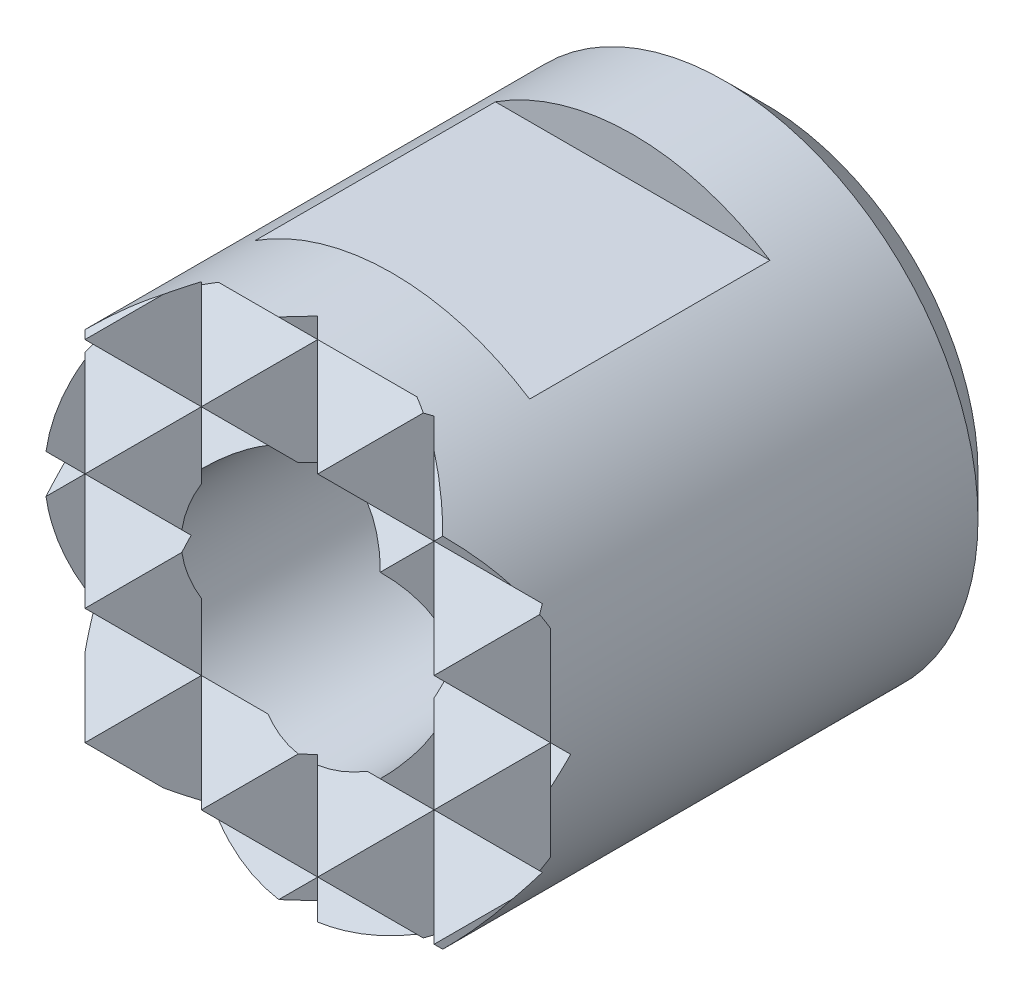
ISO-10303-21;
HEADER;
FILE_DESCRIPTION(('STEP AP214'),'2;1');
FILE_NAME('part.step','',(''),(''),'','','');
FILE_SCHEMA(('AUTOMOTIVE_DESIGN { 1 0 10303 214 1 1 1 1 }'));
ENDSEC;
DATA;
#1=APPLICATION_CONTEXT('core data for automotive mechanical design processes');
#2=APPLICATION_PROTOCOL_DEFINITION('international standard','automotive_design',2000,#1);
#3=PRODUCT_CONTEXT('',#1,'mechanical');
#4=PRODUCT('Part','Part','',(#3));
#5=PRODUCT_RELATED_PRODUCT_CATEGORY('part','',(#4));
#6=PRODUCT_DEFINITION_FORMATION('','',#4);
#7=PRODUCT_DEFINITION_CONTEXT('part definition',#1,'design');
#8=PRODUCT_DEFINITION('design','',#6,#7);
#9=PRODUCT_DEFINITION_SHAPE('','',#8);
#10=(LENGTH_UNIT() NAMED_UNIT(*) SI_UNIT(.MILLI.,.METRE.));
#11=(NAMED_UNIT(*) PLANE_ANGLE_UNIT() SI_UNIT($,.RADIAN.));
#12=(NAMED_UNIT(*) SI_UNIT($,.STERADIAN.) SOLID_ANGLE_UNIT());
#13=UNCERTAINTY_MEASURE_WITH_UNIT(LENGTH_MEASURE(1.E-05),#10,'distance_accuracy_value','');
#14=(GEOMETRIC_REPRESENTATION_CONTEXT(3) GLOBAL_UNCERTAINTY_ASSIGNED_CONTEXT((#13)) GLOBAL_UNIT_ASSIGNED_CONTEXT((#10,
#11,#12)) REPRESENTATION_CONTEXT('',''));
#15=CARTESIAN_POINT('',(0.,0.,0.));
#16=DIRECTION('',(0.,0.,1.));
#17=DIRECTION('',(1.,0.,0.));
#18=AXIS2_PLACEMENT_3D('',#15,#16,#17);
#19=CARTESIAN_POINT('',(-10.,-3.45,10.));
#20=DIRECTION('',(0.,0.707106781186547,-0.707106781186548));
#21=DIRECTION('',(0.,0.707106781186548,0.707106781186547));
#22=AXIS2_PLACEMENT_3D('',#19,#20,#21);
#23=PLANE('',#22);
#24=DIRECTION('',(-0.577350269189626,0.577350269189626,0.577350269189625));
#25=VECTOR('',#24,1.);
#26=CARTESIAN_POINT('',(-1.03333333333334,1.03333333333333,14.4833333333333));
#27=LINE('',#26,#25);
#28=CARTESIAN_POINT('',(3.53553390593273,-3.53553390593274,9.91446609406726));
#29=VERTEX_POINT('',#28);
#30=CARTESIAN_POINT('',(3.45,-3.45,10.));
#31=VERTEX_POINT('',#30);
#32=EDGE_CURVE('E450',#29,#31,#27,.T.);
#33=ORIENTED_EDGE('',*,*,#32,.T.);
#34=DIRECTION('',(-0.577350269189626,-0.577350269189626,-0.577350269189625));
#35=VECTOR('',#34,1.);
#36=CARTESIAN_POINT('',(-1.03333333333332,-7.93333333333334,5.51666666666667));
#37=LINE('',#36,#35);
#38=CARTESIAN_POINT('',(2.677018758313,-4.22298124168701,9.227018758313));
#39=VERTEX_POINT('',#38);
#40=EDGE_CURVE('E489',#31,#39,#37,.T.);
#41=ORIENTED_EDGE('',*,*,#40,.T.);
#42=CARTESIAN_POINT('',(0.,0.,13.45));
#43=DIRECTION('',(0.,0.707106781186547,-0.707106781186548));
#44=DIRECTION('',(0.,-0.707106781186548,-0.707106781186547));
#45=AXIS2_PLACEMENT_3D('',#42,#43,#44);
#46=ELLIPSE('',#45,7.07106781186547,5.);
#47=EDGE_CURVE('E1567',#29,#39,#46,.T.);
#48=ORIENTED_EDGE('',*,*,#47,.F.);
#49=EDGE_LOOP('',(#33,#41,#48));
#50=FACE_BOUND('',#49,.T.);
#51=ADVANCED_FACE('F15',(#50),#23,.F.);
#52=CARTESIAN_POINT('',(2.19327683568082,-4.49327683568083,8.95672316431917));
#53=VERTEX_POINT('',#52);
#54=CARTESIAN_POINT('',(1.95959179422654,-4.6,8.85));
#55=VERTEX_POINT('',#54);
#56=EDGE_CURVE('E674',#53,#55,#46,.T.);
#57=ORIENTED_EDGE('',*,*,#56,.F.);
#58=DIRECTION('',(-0.577350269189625,0.577350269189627,0.577350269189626));
#59=VECTOR('',#58,1.);
#60=CARTESIAN_POINT('',(-2.56666666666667,0.266666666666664,13.7166666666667));
#61=LINE('',#60,#59);
#62=CARTESIAN_POINT('',(1.15,-3.45,10.));
#63=VERTEX_POINT('',#62);
#64=EDGE_CURVE('E511',#53,#63,#61,.T.);
#65=ORIENTED_EDGE('',*,*,#64,.T.);
#66=DIRECTION('',(-0.577350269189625,-0.577350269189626,-0.577350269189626));
#67=VECTOR('',#66,1.);
#68=CARTESIAN_POINT('',(-2.56666666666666,-7.16666666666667,6.28333333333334));
#69=LINE('',#68,#67);
#70=CARTESIAN_POINT('',(0.,-4.6,8.85));
#71=VERTEX_POINT('',#70);
#72=EDGE_CURVE('E529',#63,#71,#69,.T.);
#73=ORIENTED_EDGE('',*,*,#72,.T.);
#74=DIRECTION('',(1.,0.,0.));
#75=VECTOR('',#74,1.);
#76=CARTESIAN_POINT('',(-10.,-4.6,8.85));
#77=LINE('',#76,#75);
#78=EDGE_CURVE('E582',#71,#55,#77,.T.);
#79=ORIENTED_EDGE('',*,*,#78,.T.);
#80=EDGE_LOOP('',(#57,#65,#73,#79));
#81=FACE_BOUND('',#80,.T.);
#82=ADVANCED_FACE('F844',(#81),#23,.F.);
#83=DIRECTION('',(-0.577350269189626,0.577350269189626,0.577350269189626));
#84=VECTOR('',#83,1.);
#85=CARTESIAN_POINT('',(-5.63333333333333,-1.26666666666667,12.1833333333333));
#86=LINE('',#85,#84);
#87=CARTESIAN_POINT('',(-2.677018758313,-4.222981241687,9.227018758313));
#88=VERTEX_POINT('',#87);
#89=CARTESIAN_POINT('',(-3.45,-3.45,10.));
#90=VERTEX_POINT('',#89);
#91=EDGE_CURVE('E409',#88,#90,#86,.T.);
#92=ORIENTED_EDGE('',*,*,#91,.T.);
#93=DIRECTION('',(-0.577350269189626,-0.577350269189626,-0.577350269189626));
#94=VECTOR('',#93,1.);
#95=CARTESIAN_POINT('',(-5.63333333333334,-5.63333333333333,7.81666666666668));
#96=LINE('',#95,#94);
#97=CARTESIAN_POINT('',(-3.53553390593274,-3.53553390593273,9.91446609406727));
#98=VERTEX_POINT('',#97);
#99=EDGE_CURVE('E423',#90,#98,#96,.T.);
#100=ORIENTED_EDGE('',*,*,#99,.T.);
#101=EDGE_CURVE('E670',#88,#98,#46,.T.);
#102=ORIENTED_EDGE('',*,*,#101,.F.);
#103=EDGE_LOOP('',(#92,#100,#102));
#104=FACE_BOUND('',#103,.T.);
#105=ADVANCED_FACE('F820',(#104),#23,.F.);
#106=CARTESIAN_POINT('',(-10.,-4.6,8.85));
#107=DIRECTION('',(0.,-0.707106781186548,-0.707106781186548));
#108=DIRECTION('',(0.,0.707106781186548,-0.707106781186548));
#109=AXIS2_PLACEMENT_3D('',#106,#107,#108);
#110=PLANE('',#109);
#111=CARTESIAN_POINT('',(0.,0.,4.25));
#112=DIRECTION('',(0.,-0.707106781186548,-0.707106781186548));
#113=DIRECTION('',(0.,0.707106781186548,-0.707106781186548));
#114=AXIS2_PLACEMENT_3D('',#111,#112,#113);
#115=ELLIPSE('',#114,7.07106781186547,5.);
#116=CARTESIAN_POINT('',(-0.385144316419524,-4.98514431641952,9.23514431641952));
#117=VERTEX_POINT('',#116);
#118=CARTESIAN_POINT('',(-1.95959179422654,-4.6,8.85));
#119=VERTEX_POINT('',#118);
#120=EDGE_CURVE('E676',#117,#119,#115,.T.);
#121=ORIENTED_EDGE('',*,*,#120,.F.);
#122=DIRECTION('',(0.577350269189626,0.577350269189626,-0.577350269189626));
#123=VECTOR('',#122,1.);
#124=CARTESIAN_POINT('',(-3.33333333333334,-7.93333333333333,12.1833333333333));
#125=LINE('',#124,#123);
#126=EDGE_CURVE('E550',#117,#71,#125,.T.);
#127=ORIENTED_EDGE('',*,*,#126,.T.);
#128=EDGE_CURVE('E579',#119,#71,#77,.T.);
#129=ORIENTED_EDGE('',*,*,#128,.F.);
#130=EDGE_LOOP('',(#121,#127,#129));
#131=FACE_BOUND('',#130,.T.);
#132=ADVANCED_FACE('F864',(#131),#110,.F.);
#133=CARTESIAN_POINT('',(-10.,5.75,10.));
#134=DIRECTION('',(0.,0.707106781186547,-0.707106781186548));
#135=DIRECTION('',(0.,0.707106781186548,0.707106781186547));
#136=AXIS2_PLACEMENT_3D('',#133,#134,#135);
#137=PLANE('',#136);
#138=DIRECTION('',(1.,0.,0.));
#139=VECTOR('',#138,1.);
#140=CARTESIAN_POINT('',(-10.,4.6,8.85));
#141=LINE('',#140,#139);
#142=CARTESIAN_POINT('',(-1.95959179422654,4.6,8.85));
#143=VERTEX_POINT('',#142);
#144=CARTESIAN_POINT('',(0.,4.6,8.85));
#145=VERTEX_POINT('',#144);
#146=EDGE_CURVE('E583',#143,#145,#141,.T.);
#147=ORIENTED_EDGE('',*,*,#146,.T.);
#148=DIRECTION('',(-0.577350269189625,0.577350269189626,0.577350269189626));
#149=VECTOR('',#148,1.);
#150=CARTESIAN_POINT('',(-4.1,8.7,12.95));
#151=LINE('',#150,#149);
#152=CARTESIAN_POINT('',(-0.385144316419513,4.98514431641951,9.23514431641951));
#153=VERTEX_POINT('',#152);
#154=EDGE_CURVE('E335',#145,#153,#151,.T.);
#155=ORIENTED_EDGE('',*,*,#154,.T.);
#156=CARTESIAN_POINT('',(0.,0.,4.25));
#157=DIRECTION('',(0.,0.707106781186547,-0.707106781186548));
#158=DIRECTION('',(0.,-0.707106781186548,-0.707106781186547));
#159=AXIS2_PLACEMENT_3D('',#156,#157,#158);
#160=ELLIPSE('',#159,7.07106781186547,5.);
#161=EDGE_CURVE('E667',#143,#153,#160,.T.);
#162=ORIENTED_EDGE('',*,*,#161,.F.);
#163=EDGE_LOOP('',(#147,#155,#162));
#164=FACE_BOUND('',#163,.T.);
#165=ADVANCED_FACE('F872',(#164),#137,.F.);
#166=CARTESIAN_POINT('',(-10.,4.6,8.85));
#167=DIRECTION('',(0.,-0.707106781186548,-0.707106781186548));
#168=DIRECTION('',(0.,0.707106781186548,-0.707106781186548));
#169=AXIS2_PLACEMENT_3D('',#166,#167,#168);
#170=PLANE('',#169);
#171=CARTESIAN_POINT('',(0.,0.,13.45));
#172=DIRECTION('',(0.,-0.707106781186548,-0.707106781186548));
#173=DIRECTION('',(0.,0.707106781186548,-0.707106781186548));
#174=AXIS2_PLACEMENT_3D('',#171,#172,#173);
#175=ELLIPSE('',#174,7.07106781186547,5.);
#176=CARTESIAN_POINT('',(2.67701875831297,4.22298124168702,9.22701875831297));
#177=VERTEX_POINT('',#176);
#178=CARTESIAN_POINT('',(3.53553390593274,3.53553390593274,9.91446609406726));
#179=VERTEX_POINT('',#178);
#180=EDGE_CURVE('E660',#177,#179,#175,.T.);
#181=ORIENTED_EDGE('',*,*,#180,.F.);
#182=DIRECTION('',(0.577350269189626,-0.577350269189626,0.577350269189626));
#183=VECTOR('',#182,1.);
#184=CARTESIAN_POINT('',(-1.8,8.7,4.75));
#185=LINE('',#184,#183);
#186=CARTESIAN_POINT('',(3.45,3.45,10.));
#187=VERTEX_POINT('',#186);
#188=EDGE_CURVE('E467',#177,#187,#185,.T.);
#189=ORIENTED_EDGE('',*,*,#188,.T.);
#190=DIRECTION('',(0.577350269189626,0.577350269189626,-0.577350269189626));
#191=VECTOR('',#190,1.);
#192=CARTESIAN_POINT('',(-0.266666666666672,-0.266666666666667,13.7166666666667));
#193=LINE('',#192,#191);
#194=EDGE_CURVE('E439',#187,#179,#193,.T.);
#195=ORIENTED_EDGE('',*,*,#194,.T.);
#196=EDGE_LOOP('',(#181,#189,#195));
#197=FACE_BOUND('',#196,.T.);
#198=ADVANCED_FACE('F877',(#197),#170,.F.);
#199=DIRECTION('',(0.577350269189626,-0.577350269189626,0.577350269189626));
#200=VECTOR('',#199,1.);
#201=CARTESIAN_POINT('',(-3.33333333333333,7.93333333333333,5.51666666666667));
#202=LINE('',#201,#200);
#203=CARTESIAN_POINT('',(1.15,3.45,10.));
#204=VERTEX_POINT('',#203);
#205=EDGE_CURVE('E514',#145,#204,#202,.T.);
#206=ORIENTED_EDGE('',*,*,#205,.T.);
#207=DIRECTION('',(0.577350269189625,0.577350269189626,-0.577350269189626));
#208=VECTOR('',#207,1.);
#209=CARTESIAN_POINT('',(-1.8,0.5,12.95));
#210=LINE('',#209,#208);
#211=CARTESIAN_POINT('',(2.19327683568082,4.49327683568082,8.95672316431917));
#212=VERTEX_POINT('',#211);
#213=EDGE_CURVE('E495',#204,#212,#210,.T.);
#214=ORIENTED_EDGE('',*,*,#213,.T.);
#215=CARTESIAN_POINT('',(1.95959179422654,4.6,8.85));
#216=VERTEX_POINT('',#215);
#217=EDGE_CURVE('E662',#216,#212,#175,.T.);
#218=ORIENTED_EDGE('',*,*,#217,.F.);
#219=EDGE_CURVE('E585',#145,#216,#141,.T.);
#220=ORIENTED_EDGE('',*,*,#219,.F.);
#221=EDGE_LOOP('',(#206,#214,#218,#220));
#222=FACE_BOUND('',#221,.T.);
#223=ADVANCED_FACE('F1415',(#222),#170,.F.);
#224=CARTESIAN_POINT('',(-3.53553390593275,3.53553390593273,9.91446609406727));
#225=VERTEX_POINT('',#224);
#226=CARTESIAN_POINT('',(-2.67701875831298,4.22298124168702,9.22701875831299));
#227=VERTEX_POINT('',#226);
#228=EDGE_CURVE('E666',#225,#227,#175,.T.);
#229=ORIENTED_EDGE('',*,*,#228,.F.);
#230=DIRECTION('',(0.577350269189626,-0.577350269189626,0.577350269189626));
#231=VECTOR('',#230,1.);
#232=CARTESIAN_POINT('',(-6.4,6.4,7.05));
#233=LINE('',#232,#231);
#234=CARTESIAN_POINT('',(-3.45,3.45,10.));
#235=VERTEX_POINT('',#234);
#236=EDGE_CURVE('E412',#225,#235,#233,.T.);
#237=ORIENTED_EDGE('',*,*,#236,.T.);
#238=DIRECTION('',(0.577350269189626,0.577350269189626,-0.577350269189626));
#239=VECTOR('',#238,1.);
#240=CARTESIAN_POINT('',(-4.86666666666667,2.03333333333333,11.4166666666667));
#241=LINE('',#240,#239);
#242=EDGE_CURVE('E387',#235,#227,#241,.T.);
#243=ORIENTED_EDGE('',*,*,#242,.T.);
#244=EDGE_LOOP('',(#229,#237,#243));
#245=FACE_BOUND('',#244,.T.);
#246=ADVANCED_FACE('F886',(#245),#170,.F.);
#247=CARTESIAN_POINT('',(-10.,2.3,8.85));
#248=DIRECTION('',(0.,-0.707106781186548,-0.707106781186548));
#249=DIRECTION('',(0.,0.707106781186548,-0.707106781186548));
#250=AXIS2_PLACEMENT_3D('',#247,#248,#249);
#251=PLANE('',#250);
#252=CARTESIAN_POINT('',(0.,0.,11.15));
#253=DIRECTION('',(0.,-0.707106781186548,-0.707106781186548));
#254=DIRECTION('',(0.,-0.707106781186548,0.707106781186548));
#255=AXIS2_PLACEMENT_3D('',#252,#253,#254);
#256=ELLIPSE('',#255,3.53553390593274,2.5);
#257=CARTESIAN_POINT('',(0.979795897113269,2.3,8.85));
#258=VERTEX_POINT('',#257);
#259=CARTESIAN_POINT('',(1.76776695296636,1.76776695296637,9.38223304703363));
#260=VERTEX_POINT('',#259);
#261=EDGE_CURVE('E641',#258,#260,#256,.T.);
#262=ORIENTED_EDGE('',*,*,#261,.T.);
#263=DIRECTION('',(0.577350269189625,0.577350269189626,-0.577350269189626));
#264=VECTOR('',#263,1.);
#265=CARTESIAN_POINT('',(-1.8,-1.8,12.95));
#266=LINE('',#265,#264);
#267=CARTESIAN_POINT('',(2.3,2.3,8.85));
#268=VERTEX_POINT('',#267);
#269=EDGE_CURVE('E492',#260,#268,#266,.T.);
#270=ORIENTED_EDGE('',*,*,#269,.T.);
#271=DIRECTION('',(1.,0.,0.));
#272=VECTOR('',#271,1.);
#273=CARTESIAN_POINT('',(-10.,2.3,8.85));
#274=LINE('',#273,#272);
#275=EDGE_CURVE('E586',#258,#268,#274,.T.);
#276=ORIENTED_EDGE('',*,*,#275,.F.);
#277=EDGE_LOOP('',(#262,#270,#276));
#278=FACE_BOUND('',#277,.T.);
#279=ADVANCED_FACE('F776',(#278),#251,.F.);
#280=CARTESIAN_POINT('',(0.,0.,11.15));
#281=DIRECTION('',(0.,-0.707106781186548,-0.707106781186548));
#282=DIRECTION('',(0.,0.707106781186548,-0.707106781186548));
#283=AXIS2_PLACEMENT_3D('',#280,#281,#282);
#284=ELLIPSE('',#283,7.07106781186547,5.);
#285=CARTESIAN_POINT('',(-4.49327683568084,2.19327683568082,8.95672316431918));
#286=VERTEX_POINT('',#285);
#287=CARTESIAN_POINT('',(-4.43959457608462,2.3,8.85));
#288=VERTEX_POINT('',#287);
#289=EDGE_CURVE('E607',#286,#288,#284,.T.);
#290=ORIENTED_EDGE('',*,*,#289,.F.);
#291=DIRECTION('',(0.577350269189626,-0.577350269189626,0.577350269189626));
#292=VECTOR('',#291,1.);
#293=CARTESIAN_POINT('',(-6.4,4.1,7.05));
#294=LINE('',#293,#292);
#295=CARTESIAN_POINT('',(-3.45,1.15,10.));
#296=VERTEX_POINT('',#295);
#297=EDGE_CURVE('E435',#286,#296,#294,.T.);
#298=ORIENTED_EDGE('',*,*,#297,.T.);
#299=DIRECTION('',(0.577350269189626,0.577350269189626,-0.577350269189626));
#300=VECTOR('',#299,1.);
#301=CARTESIAN_POINT('',(-4.86666666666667,-0.266666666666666,11.4166666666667));
#302=LINE('',#301,#300);
#303=CARTESIAN_POINT('',(-2.3,2.3,8.85));
#304=VERTEX_POINT('',#303);
#305=EDGE_CURVE('E30',#296,#304,#302,.T.);
#306=ORIENTED_EDGE('',*,*,#305,.T.);
#307=EDGE_CURVE('E591',#288,#304,#274,.T.);
#308=ORIENTED_EDGE('',*,*,#307,.F.);
#309=EDGE_LOOP('',(#290,#298,#306,#308));
#310=FACE_BOUND('',#309,.T.);
#311=ADVANCED_FACE('F990',(#310),#251,.F.);
#312=CARTESIAN_POINT('',(-10.,1.15,10.));
#313=DIRECTION('',(0.,0.707106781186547,-0.707106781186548));
#314=DIRECTION('',(0.,0.707106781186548,0.707106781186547));
#315=AXIS2_PLACEMENT_3D('',#312,#313,#314);
#316=PLANE('',#315);
#317=DIRECTION('',(1.,0.,0.));
#318=VECTOR('',#317,1.);
#319=CARTESIAN_POINT('',(-10.,0.,8.85));
#320=LINE('',#319,#318);
#321=CARTESIAN_POINT('',(-5.,0.,8.85));
#322=VERTEX_POINT('',#321);
#323=CARTESIAN_POINT('',(-4.59999999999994,0.,8.85));
#324=VERTEX_POINT('',#323);
#325=EDGE_CURVE('E572',#322,#324,#320,.T.);
#326=ORIENTED_EDGE('',*,*,#325,.T.);
#327=DIRECTION('',(-0.577350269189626,0.577350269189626,0.577350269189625));
#328=VECTOR('',#327,1.);
#329=CARTESIAN_POINT('',(-7.16666666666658,2.56666666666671,11.4166666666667));
#330=LINE('',#329,#328);
#331=CARTESIAN_POINT('',(-4.9851443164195,0.385144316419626,9.23514431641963));
#332=VERTEX_POINT('',#331);
#333=EDGE_CURVE('E553',#324,#332,#330,.T.);
#334=ORIENTED_EDGE('',*,*,#333,.T.);
#335=CARTESIAN_POINT('',(0.,0.,8.85));
#336=DIRECTION('',(0.,0.707106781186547,-0.707106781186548));
#337=DIRECTION('',(0.,-0.707106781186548,-0.707106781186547));
#338=AXIS2_PLACEMENT_3D('',#335,#336,#337);
#339=ELLIPSE('',#338,7.07106781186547,5.);
#340=EDGE_CURVE('E606',#322,#332,#339,.T.);
#341=ORIENTED_EDGE('',*,*,#340,.F.);
#342=EDGE_LOOP('',(#326,#334,#341));
#343=FACE_BOUND('',#342,.T.);
#344=ADVANCED_FACE('F1001',(#343),#316,.F.);
#345=DIRECTION('',(-0.577350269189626,0.577350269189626,0.577350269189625));
#346=VECTOR('',#345,1.);
#347=CARTESIAN_POINT('',(-1.03333333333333,5.63333333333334,14.4833333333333));
#348=LINE('',#347,#346);
#349=CARTESIAN_POINT('',(4.6,0.,8.85));
#350=VERTEX_POINT('',#349);
#351=CARTESIAN_POINT('',(3.45,1.15,10.));
#352=VERTEX_POINT('',#351);
#353=EDGE_CURVE('E459',#350,#352,#348,.T.);
#354=ORIENTED_EDGE('',*,*,#353,.T.);
#355=DIRECTION('',(-0.577350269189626,-0.577350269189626,-0.577350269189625));
#356=VECTOR('',#355,1.);
#357=CARTESIAN_POINT('',(-1.03333333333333,-3.33333333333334,5.51666666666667));
#358=LINE('',#357,#356);
#359=CARTESIAN_POINT('',(2.49257215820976,0.19257215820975,9.04257215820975));
#360=VERTEX_POINT('',#359);
#361=EDGE_CURVE('E473',#352,#360,#358,.T.);
#362=ORIENTED_EDGE('',*,*,#361,.T.);
#363=CARTESIAN_POINT('',(0.,0.,8.85));
#364=DIRECTION('',(0.,0.707106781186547,-0.707106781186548));
#365=DIRECTION('',(0.,0.707106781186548,0.707106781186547));
#366=AXIS2_PLACEMENT_3D('',#363,#364,#365);
#367=ELLIPSE('',#366,3.53553390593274,2.5);
#368=CARTESIAN_POINT('',(2.5,0.,8.85));
#369=VERTEX_POINT('',#368);
#370=EDGE_CURVE('E648',#360,#369,#367,.T.);
#371=ORIENTED_EDGE('',*,*,#370,.T.);
#372=EDGE_CURVE('E567',#369,#350,#320,.T.);
#373=ORIENTED_EDGE('',*,*,#372,.T.);
#374=EDGE_LOOP('',(#354,#362,#371,#373));
#375=FACE_BOUND('',#374,.T.);
#376=ADVANCED_FACE('F1011',(#375),#316,.F.);
#377=CARTESIAN_POINT('',(-10.,0.,8.85));
#378=DIRECTION('',(0.,-0.707106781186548,-0.707106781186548));
#379=DIRECTION('',(0.,0.707106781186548,-0.707106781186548));
#380=AXIS2_PLACEMENT_3D('',#377,#378,#379);
#381=PLANE('',#380);
#382=CARTESIAN_POINT('',(0.,0.,8.85));
#383=DIRECTION('',(0.,-0.707106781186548,-0.707106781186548));
#384=DIRECTION('',(0.,-0.707106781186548,0.707106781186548));
#385=AXIS2_PLACEMENT_3D('',#382,#383,#384);
#386=ELLIPSE('',#385,3.53553390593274,2.5);
#387=CARTESIAN_POINT('',(2.49257215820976,-0.192572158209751,9.04257215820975));
#388=VERTEX_POINT('',#387);
#389=EDGE_CURVE('E649',#369,#388,#386,.T.);
#390=ORIENTED_EDGE('',*,*,#389,.T.);
#391=DIRECTION('',(0.577350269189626,-0.577350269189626,0.577350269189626));
#392=VECTOR('',#391,1.);
#393=CARTESIAN_POINT('',(-1.8,4.1,4.75));
#394=LINE('',#393,#392);
#395=CARTESIAN_POINT('',(3.45,-1.15,10.));
#396=VERTEX_POINT('',#395);
#397=EDGE_CURVE('E486',#388,#396,#394,.T.);
#398=ORIENTED_EDGE('',*,*,#397,.T.);
#399=DIRECTION('',(0.577350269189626,0.577350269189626,-0.577350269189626));
#400=VECTOR('',#399,1.);
#401=CARTESIAN_POINT('',(-0.266666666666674,-4.86666666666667,13.7166666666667));
#402=LINE('',#401,#400);
#403=EDGE_CURVE('E456',#396,#350,#402,.T.);
#404=ORIENTED_EDGE('',*,*,#403,.T.);
#405=ORIENTED_EDGE('',*,*,#372,.F.);
#406=EDGE_LOOP('',(#390,#398,#404,#405));
#407=FACE_BOUND('',#406,.T.);
#408=ADVANCED_FACE('F1022',(#407),#381,.F.);
#409=CARTESIAN_POINT('',(0.,0.,8.85));
#410=DIRECTION('',(0.,-0.707106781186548,-0.707106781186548));
#411=DIRECTION('',(0.,0.707106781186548,-0.707106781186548));
#412=AXIS2_PLACEMENT_3D('',#409,#410,#411);
#413=ELLIPSE('',#412,7.07106781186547,5.);
#414=CARTESIAN_POINT('',(-4.9851443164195,-0.385144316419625,9.23514431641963));
#415=VERTEX_POINT('',#414);
#416=EDGE_CURVE('E601',#415,#322,#413,.T.);
#417=ORIENTED_EDGE('',*,*,#416,.F.);
#418=DIRECTION('',(0.577350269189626,0.577350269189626,-0.577350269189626));
#419=VECTOR('',#418,1.);
#420=CARTESIAN_POINT('',(-6.39999999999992,-1.80000000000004,10.65));
#421=LINE('',#420,#419);
#422=EDGE_CURVE('E23',#415,#324,#421,.T.);
#423=ORIENTED_EDGE('',*,*,#422,.T.);
#424=ORIENTED_EDGE('',*,*,#325,.F.);
#425=EDGE_LOOP('',(#417,#423,#424));
#426=FACE_BOUND('',#425,.T.);
#427=ADVANCED_FACE('F696',(#426),#381,.F.);
#428=CARTESIAN_POINT('',(-10.,-1.15,10.));
#429=DIRECTION('',(0.,0.707106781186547,-0.707106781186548));
#430=DIRECTION('',(0.,0.707106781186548,0.707106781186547));
#431=AXIS2_PLACEMENT_3D('',#428,#429,#430);
#432=PLANE('',#431);
#433=DIRECTION('',(-0.577350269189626,0.577350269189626,0.577350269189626));
#434=VECTOR('',#433,1.);
#435=CARTESIAN_POINT('',(-5.63333333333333,1.03333333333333,12.1833333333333));
#436=LINE('',#435,#434);
#437=CARTESIAN_POINT('',(-2.3,-2.3,8.85));
#438=VERTEX_POINT('',#437);
#439=CARTESIAN_POINT('',(-3.45,-1.15,10.));
#440=VERTEX_POINT('',#439);
#441=EDGE_CURVE('E403',#438,#440,#436,.T.);
#442=ORIENTED_EDGE('',*,*,#441,.T.);
#443=DIRECTION('',(-0.577350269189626,-0.577350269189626,-0.577350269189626));
#444=VECTOR('',#443,1.);
#445=CARTESIAN_POINT('',(-5.63333333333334,-3.33333333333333,7.81666666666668));
#446=LINE('',#445,#444);
#447=CARTESIAN_POINT('',(-4.49327683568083,-2.19327683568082,8.95672316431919));
#448=VERTEX_POINT('',#447);
#449=EDGE_CURVE('E426',#440,#448,#446,.T.);
#450=ORIENTED_EDGE('',*,*,#449,.T.);
#451=CARTESIAN_POINT('',(0.,0.,11.15));
#452=DIRECTION('',(0.,0.707106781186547,-0.707106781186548));
#453=DIRECTION('',(0.,-0.707106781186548,-0.707106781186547));
#454=AXIS2_PLACEMENT_3D('',#451,#452,#453);
#455=ELLIPSE('',#454,7.07106781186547,5.);
#456=CARTESIAN_POINT('',(-4.43959457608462,-2.3,8.85));
#457=VERTEX_POINT('',#456);
#458=EDGE_CURVE('E600',#457,#448,#455,.T.);
#459=ORIENTED_EDGE('',*,*,#458,.F.);
#460=DIRECTION('',(1.,0.,0.));
#461=VECTOR('',#460,1.);
#462=CARTESIAN_POINT('',(-10.,-2.3,8.85));
#463=LINE('',#462,#461);
#464=EDGE_CURVE('E578',#457,#438,#463,.T.);
#465=ORIENTED_EDGE('',*,*,#464,.T.);
#466=EDGE_LOOP('',(#442,#450,#459,#465));
#467=FACE_BOUND('',#466,.T.);
#468=ADVANCED_FACE('F1041',(#467),#432,.F.);
#469=CARTESIAN_POINT('',(0.979795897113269,-2.3,8.85));
#470=VERTEX_POINT('',#469);
#471=CARTESIAN_POINT('',(2.3,-2.3,8.85));
#472=VERTEX_POINT('',#471);
#473=EDGE_CURVE('E573',#470,#472,#463,.T.);
#474=ORIENTED_EDGE('',*,*,#473,.T.);
#475=DIRECTION('',(-0.577350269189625,0.577350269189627,0.577350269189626));
#476=VECTOR('',#475,1.);
#477=CARTESIAN_POINT('',(-2.56666666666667,2.56666666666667,13.7166666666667));
#478=LINE('',#477,#476);
#479=CARTESIAN_POINT('',(1.76776695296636,-1.76776695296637,9.38223304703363));
#480=VERTEX_POINT('',#479);
#481=EDGE_CURVE('E508',#472,#480,#478,.T.);
#482=ORIENTED_EDGE('',*,*,#481,.T.);
#483=CARTESIAN_POINT('',(0.,0.,11.15));
#484=DIRECTION('',(0.,0.707106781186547,-0.707106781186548));
#485=DIRECTION('',(0.,0.707106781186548,0.707106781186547));
#486=AXIS2_PLACEMENT_3D('',#483,#484,#485);
#487=ELLIPSE('',#486,3.53553390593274,2.5);
#488=EDGE_CURVE('E656',#480,#470,#487,.T.);
#489=ORIENTED_EDGE('',*,*,#488,.T.);
#490=EDGE_LOOP('',(#474,#482,#489));
#491=FACE_BOUND('',#490,.T.);
#492=ADVANCED_FACE('F1049',(#491),#432,.F.);
#493=CARTESIAN_POINT('',(-10.,-2.3,8.85));
#494=DIRECTION('',(0.,-0.707106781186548,-0.707106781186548));
#495=DIRECTION('',(0.,0.707106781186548,-0.707106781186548));
#496=AXIS2_PLACEMENT_3D('',#493,#494,#495);
#497=PLANE('',#496);
#498=CARTESIAN_POINT('',(0.,0.,6.55));
#499=DIRECTION('',(0.,-0.707106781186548,-0.707106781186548));
#500=DIRECTION('',(0.,-0.707106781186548,0.707106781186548));
#501=AXIS2_PLACEMENT_3D('',#498,#499,#500);
#502=ELLIPSE('',#501,3.53553390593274,2.5);
#503=CARTESIAN_POINT('',(0.192572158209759,-2.49257215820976,9.04257215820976));
#504=VERTEX_POINT('',#503);
#505=EDGE_CURVE('E657',#470,#504,#502,.T.);
#506=ORIENTED_EDGE('',*,*,#505,.T.);
#507=DIRECTION('',(0.577350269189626,-0.577350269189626,0.577350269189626));
#508=VECTOR('',#507,1.);
#509=CARTESIAN_POINT('',(-3.33333333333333,1.03333333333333,5.51666666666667));
#510=LINE('',#509,#508);
#511=EDGE_CURVE('E526',#504,#63,#510,.T.);
#512=ORIENTED_EDGE('',*,*,#511,.T.);
#513=DIRECTION('',(0.577350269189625,0.577350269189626,-0.577350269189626));
#514=VECTOR('',#513,1.);
#515=CARTESIAN_POINT('',(-1.8,-6.4,12.95));
#516=LINE('',#515,#514);
#517=EDGE_CURVE('E504',#63,#472,#516,.T.);
#518=ORIENTED_EDGE('',*,*,#517,.T.);
#519=ORIENTED_EDGE('',*,*,#473,.F.);
#520=EDGE_LOOP('',(#506,#512,#518,#519));
#521=FACE_BOUND('',#520,.T.);
#522=ADVANCED_FACE('F1058',(#521),#497,.F.);
#523=CARTESIAN_POINT('',(4.43959457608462,-2.3,8.85));
#524=VERTEX_POINT('',#523);
#525=EDGE_CURVE('E577',#472,#524,#463,.T.);
#526=ORIENTED_EDGE('',*,*,#525,.F.);
#527=DIRECTION('',(0.577350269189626,-0.577350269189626,0.577350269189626));
#528=VECTOR('',#527,1.);
#529=CARTESIAN_POINT('',(-1.8,1.8,4.75));
#530=LINE('',#529,#528);
#531=EDGE_CURVE('E479',#472,#31,#530,.T.);
#532=ORIENTED_EDGE('',*,*,#531,.T.);
#533=DIRECTION('',(0.577350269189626,0.577350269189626,-0.577350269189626));
#534=VECTOR('',#533,1.);
#535=CARTESIAN_POINT('',(-0.266666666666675,-7.16666666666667,13.7166666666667));
#536=LINE('',#535,#534);
#537=CARTESIAN_POINT('',(4.22298124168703,-2.67701875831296,9.22701875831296));
#538=VERTEX_POINT('',#537);
#539=EDGE_CURVE('E445',#31,#538,#536,.T.);
#540=ORIENTED_EDGE('',*,*,#539,.T.);
#541=CARTESIAN_POINT('',(0.,0.,6.55));
#542=DIRECTION('',(0.,-0.707106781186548,-0.707106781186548));
#543=DIRECTION('',(0.,0.707106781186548,-0.707106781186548));
#544=AXIS2_PLACEMENT_3D('',#541,#542,#543);
#545=ELLIPSE('',#544,7.07106781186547,5.);
#546=EDGE_CURVE('E597',#524,#538,#545,.T.);
#547=ORIENTED_EDGE('',*,*,#546,.F.);
#548=EDGE_LOOP('',(#526,#532,#540,#547));
#549=FACE_BOUND('',#548,.T.);
#550=ADVANCED_FACE('F733',(#549),#497,.F.);
#551=CARTESIAN_POINT('',(-4.22298124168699,-2.67701875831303,9.22701875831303));
#552=VERTEX_POINT('',#551);
#553=EDGE_CURVE('E595',#552,#457,#545,.T.);
#554=ORIENTED_EDGE('',*,*,#553,.F.);
#555=DIRECTION('',(0.577350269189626,-0.577350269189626,0.577350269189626));
#556=VECTOR('',#555,1.);
#557=CARTESIAN_POINT('',(-6.4,-0.5,7.05));
#558=LINE('',#557,#556);
#559=EDGE_CURVE('E418',#552,#90,#558,.T.);
#560=ORIENTED_EDGE('',*,*,#559,.T.);
#561=DIRECTION('',(0.577350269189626,0.577350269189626,-0.577350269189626));
#562=VECTOR('',#561,1.);
#563=CARTESIAN_POINT('',(-4.86666666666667,-4.86666666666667,11.4166666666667));
#564=LINE('',#563,#562);
#565=EDGE_CURVE('E399',#90,#438,#564,.T.);
#566=ORIENTED_EDGE('',*,*,#565,.T.);
#567=ORIENTED_EDGE('',*,*,#464,.F.);
#568=EDGE_LOOP('',(#554,#560,#566,#567));
#569=FACE_BOUND('',#568,.T.);
#570=ADVANCED_FACE('F720',(#569),#497,.F.);
#571=CARTESIAN_POINT('',(-10.,3.45,10.));
#572=DIRECTION('',(0.,0.707106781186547,-0.707106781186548));
#573=DIRECTION('',(0.,0.707106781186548,0.707106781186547));
#574=AXIS2_PLACEMENT_3D('',#571,#572,#573);
#575=PLANE('',#574);
#576=DIRECTION('',(-0.577350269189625,0.577350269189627,0.577350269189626));
#577=VECTOR('',#576,1.);
#578=CARTESIAN_POINT('',(-2.56666666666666,7.16666666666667,13.7166666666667));
#579=LINE('',#578,#577);
#580=EDGE_CURVE('E687',#268,#204,#579,.T.);
#581=ORIENTED_EDGE('',*,*,#580,.T.);
#582=DIRECTION('',(-0.577350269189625,-0.577350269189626,-0.577350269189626));
#583=VECTOR('',#582,1.);
#584=CARTESIAN_POINT('',(-2.56666666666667,-0.266666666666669,6.28333333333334));
#585=LINE('',#584,#583);
#586=CARTESIAN_POINT('',(0.192572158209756,2.49257215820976,9.04257215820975));
#587=VERTEX_POINT('',#586);
#588=EDGE_CURVE('E690',#204,#587,#585,.T.);
#589=ORIENTED_EDGE('',*,*,#588,.T.);
#590=CARTESIAN_POINT('',(0.,0.,6.55));
#591=DIRECTION('',(0.,0.707106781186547,-0.707106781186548));
#592=DIRECTION('',(0.,0.707106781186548,0.707106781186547));
#593=AXIS2_PLACEMENT_3D('',#590,#591,#592);
#594=ELLIPSE('',#593,3.53553390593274,2.5);
#595=EDGE_CURVE('E639',#587,#258,#594,.T.);
#596=ORIENTED_EDGE('',*,*,#595,.T.);
#597=ORIENTED_EDGE('',*,*,#275,.T.);
#598=EDGE_LOOP('',(#581,#589,#596,#597));
#599=FACE_BOUND('',#598,.T.);
#600=ADVANCED_FACE('F780',(#599),#575,.F.);
#601=DIRECTION('',(-0.577350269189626,0.577350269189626,0.577350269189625));
#602=VECTOR('',#601,1.);
#603=CARTESIAN_POINT('',(-1.03333333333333,7.93333333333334,14.4833333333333));
#604=LINE('',#603,#602);
#605=CARTESIAN_POINT('',(4.22298124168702,2.67701875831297,9.22701875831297));
#606=VERTEX_POINT('',#605);
#607=EDGE_CURVE('E358',#606,#187,#604,.T.);
#608=ORIENTED_EDGE('',*,*,#607,.T.);
#609=DIRECTION('',(-0.577350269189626,-0.577350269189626,-0.577350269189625));
#610=VECTOR('',#609,1.);
#611=CARTESIAN_POINT('',(-1.03333333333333,-1.03333333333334,5.51666666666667));
#612=LINE('',#611,#610);
#613=EDGE_CURVE('E684',#187,#268,#612,.T.);
#614=ORIENTED_EDGE('',*,*,#613,.T.);
#615=CARTESIAN_POINT('',(4.43959457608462,2.3,8.85));
#616=VERTEX_POINT('',#615);
#617=EDGE_CURVE('E590',#268,#616,#274,.T.);
#618=ORIENTED_EDGE('',*,*,#617,.T.);
#619=CARTESIAN_POINT('',(0.,0.,6.55));
#620=DIRECTION('',(0.,0.707106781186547,-0.707106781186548));
#621=DIRECTION('',(0.,-0.707106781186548,-0.707106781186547));
#622=AXIS2_PLACEMENT_3D('',#619,#620,#621);
#623=ELLIPSE('',#622,7.07106781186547,5.);
#624=EDGE_CURVE('E592',#606,#616,#623,.T.);
#625=ORIENTED_EDGE('',*,*,#624,.F.);
#626=EDGE_LOOP('',(#608,#614,#618,#625));
#627=FACE_BOUND('',#626,.T.);
#628=ADVANCED_FACE('F1438',(#627),#575,.F.);
#629=DIRECTION('',(-0.577350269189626,0.577350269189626,0.577350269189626));
#630=VECTOR('',#629,1.);
#631=CARTESIAN_POINT('',(-5.63333333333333,5.63333333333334,12.1833333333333));
#632=LINE('',#631,#630);
#633=EDGE_CURVE('E351',#304,#235,#632,.T.);
#634=ORIENTED_EDGE('',*,*,#633,.T.);
#635=DIRECTION('',(-0.577350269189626,-0.577350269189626,-0.577350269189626));
#636=VECTOR('',#635,1.);
#637=CARTESIAN_POINT('',(-5.63333333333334,1.26666666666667,7.81666666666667));
#638=LINE('',#637,#636);
#639=CARTESIAN_POINT('',(-4.22298124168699,2.67701875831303,9.22701875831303));
#640=VERTEX_POINT('',#639);
#641=EDGE_CURVE('E359',#235,#640,#638,.T.);
#642=ORIENTED_EDGE('',*,*,#641,.T.);
#643=EDGE_CURVE('E594',#288,#640,#623,.T.);
#644=ORIENTED_EDGE('',*,*,#643,.F.);
#645=ORIENTED_EDGE('',*,*,#307,.T.);
#646=EDGE_LOOP('',(#634,#642,#644,#645));
#647=FACE_BOUND('',#646,.T.);
#648=ADVANCED_FACE('F890',(#647),#575,.F.);
#649=CARTESIAN_POINT('',(0.,0.,0.));
#650=DIRECTION('',(0.,0.,1.));
#651=DIRECTION('',(1.,0.,0.));
#652=AXIS2_PLACEMENT_3D('',#649,#650,#651);
#653=PLANE('',#652);
#654=CARTESIAN_POINT('',(0.,0.,0.));
#655=DIRECTION('',(0.,0.,1.));
#656=DIRECTION('',(1.,0.,0.));
#657=AXIS2_PLACEMENT_3D('',#654,#655,#656);
#658=CIRCLE('',#657,4.2);
#659=CARTESIAN_POINT('',(4.2,0.,0.));
#660=VERTEX_POINT('',#659);
#661=EDGE_CURVE('E624',#660,#660,#658,.F.);
#662=ORIENTED_EDGE('',*,*,#661,.T.);
#663=EDGE_LOOP('',(#662));
#664=FACE_BOUND('',#663,.T.);
#665=CARTESIAN_POINT('',(0.,0.,0.));
#666=DIRECTION('',(0.,0.,1.));
#667=DIRECTION('',(1.,0.,0.));
#668=AXIS2_PLACEMENT_3D('',#665,#666,#667);
#669=CIRCLE('',#668,2.95);
#670=CARTESIAN_POINT('',(2.95,0.,0.));
#671=VERTEX_POINT('',#670);
#672=EDGE_CURVE('E618',#671,#671,#669,.T.);
#673=ORIENTED_EDGE('',*,*,#672,.T.);
#674=EDGE_LOOP('',(#673));
#675=FACE_BOUND('',#674,.T.);
#676=ADVANCED_FACE('F904',(#664,#675),#653,.F.);
#677=CARTESIAN_POINT('',(0.,0.,10.));
#678=DIRECTION('',(0.,0.,-1.));
#679=DIRECTION('',(-1.,0.,0.));
#680=AXIS2_PLACEMENT_3D('',#677,#678,#679);
#681=CYLINDRICAL_SURFACE('',#680,5.);
#682=CARTESIAN_POINT('',(0.,0.,7.375));
#683=DIRECTION('',(0.,0.,1.));
#684=DIRECTION('',(1.,0.,0.));
#685=AXIS2_PLACEMENT_3D('',#682,#683,#684);
#686=CIRCLE('',#685,5.);
#687=CARTESIAN_POINT('',(2.71293199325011,4.2,7.375));
#688=VERTEX_POINT('',#687);
#689=CARTESIAN_POINT('',(-2.71293199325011,4.2,7.375));
#690=VERTEX_POINT('',#689);
#691=EDGE_CURVE('E633',#688,#690,#686,.T.);
#692=ORIENTED_EDGE('',*,*,#691,.T.);
#693=DIRECTION('',(0.,0.,-1.));
#694=VECTOR('',#693,1.);
#695=CARTESIAN_POINT('',(-2.71293199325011,4.2,10.));
#696=LINE('',#695,#694);
#697=CARTESIAN_POINT('',(-2.71293199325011,4.2,2.625));
#698=VERTEX_POINT('',#697);
#699=EDGE_CURVE('E636',#690,#698,#696,.T.);
#700=ORIENTED_EDGE('',*,*,#699,.T.);
#701=CARTESIAN_POINT('',(0.,0.,2.625));
#702=DIRECTION('',(0.,0.,-1.));
#703=DIRECTION('',(0.,1.,0.));
#704=AXIS2_PLACEMENT_3D('',#701,#702,#703);
#705=CIRCLE('',#704,5.);
#706=CARTESIAN_POINT('',(2.71293199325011,4.2,2.625));
#707=VERTEX_POINT('',#706);
#708=EDGE_CURVE('E630',#698,#707,#705,.T.);
#709=ORIENTED_EDGE('',*,*,#708,.T.);
#710=DIRECTION('',(0.,0.,-1.));
#711=VECTOR('',#710,1.);
#712=CARTESIAN_POINT('',(2.71293199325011,4.2,10.));
#713=LINE('',#712,#711);
#714=EDGE_CURVE('E627',#707,#688,#713,.F.);
#715=ORIENTED_EDGE('',*,*,#714,.T.);
#716=EDGE_LOOP('',(#692,#700,#709,#715));
#717=FACE_BOUND('',#716,.T.);
#718=CARTESIAN_POINT('',(0.,0.,0.8));
#719=DIRECTION('',(0.,0.,1.));
#720=DIRECTION('',(1.,0.,0.));
#721=AXIS2_PLACEMENT_3D('',#718,#719,#720);
#722=CIRCLE('',#721,5.);
#723=CARTESIAN_POINT('',(5.,0.,0.8));
#724=VERTEX_POINT('',#723);
#725=EDGE_CURVE('E621',#724,#724,#722,.T.);
#726=ORIENTED_EDGE('',*,*,#725,.T.);
#727=EDGE_LOOP('',(#726));
#728=FACE_BOUND('',#727,.T.);
#729=ORIENTED_EDGE('',*,*,#161,.T.);
#730=CARTESIAN_POINT('',(0.,0.,8.85));
#731=DIRECTION('',(-0.707106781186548,0.,-0.707106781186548));
#732=DIRECTION('',(0.707106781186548,0.,-0.707106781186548));
#733=AXIS2_PLACEMENT_3D('',#730,#731,#732);
#734=ELLIPSE('',#733,7.07106781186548,5.);
#735=CARTESIAN_POINT('',(0.,5.,8.85));
#736=VERTEX_POINT('',#735);
#737=EDGE_CURVE('E539',#153,#736,#734,.T.);
#738=ORIENTED_EDGE('',*,*,#737,.T.);
#739=CARTESIAN_POINT('',(0.,0.,8.85));
#740=DIRECTION('',(0.707106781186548,0.,-0.707106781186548));
#741=DIRECTION('',(-0.707106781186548,0.,-0.707106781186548));
#742=AXIS2_PLACEMENT_3D('',#739,#740,#741);
#743=ELLIPSE('',#742,7.07106781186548,5.);
#744=CARTESIAN_POINT('',(0.385144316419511,4.98514431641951,9.23514431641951));
#745=VERTEX_POINT('',#744);
#746=EDGE_CURVE('E522',#736,#745,#743,.T.);
#747=ORIENTED_EDGE('',*,*,#746,.T.);
#748=EDGE_CURVE('E665',#745,#216,#160,.T.);
#749=ORIENTED_EDGE('',*,*,#748,.T.);
#750=ORIENTED_EDGE('',*,*,#217,.T.);
#751=CARTESIAN_POINT('',(0.,0.,11.15));
#752=DIRECTION('',(-0.707106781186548,0.,-0.707106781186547));
#753=DIRECTION('',(0.707106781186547,0.,-0.707106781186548));
#754=AXIS2_PLACEMENT_3D('',#751,#752,#753);
#755=ELLIPSE('',#754,7.07106781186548,5.);
#756=CARTESIAN_POINT('',(2.3,4.43959457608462,8.85));
#757=VERTEX_POINT('',#756);
#758=EDGE_CURVE('E500',#212,#757,#755,.T.);
#759=ORIENTED_EDGE('',*,*,#758,.T.);
#760=CARTESIAN_POINT('',(0.,0.,6.55));
#761=DIRECTION('',(0.707106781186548,0.,-0.707106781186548));
#762=DIRECTION('',(-0.707106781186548,0.,-0.707106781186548));
#763=AXIS2_PLACEMENT_3D('',#760,#761,#762);
#764=ELLIPSE('',#763,7.07106781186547,5.);
#765=EDGE_CURVE('E470',#757,#177,#764,.T.);
#766=ORIENTED_EDGE('',*,*,#765,.T.);
#767=ORIENTED_EDGE('',*,*,#180,.T.);
#768=CARTESIAN_POINT('',(0.,0.,13.45));
#769=DIRECTION('',(-0.707106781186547,0.,-0.707106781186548));
#770=DIRECTION('',(0.707106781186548,0.,-0.707106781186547));
#771=AXIS2_PLACEMENT_3D('',#768,#769,#770);
#772=ELLIPSE('',#771,7.07106781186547,5.);
#773=EDGE_CURVE('E442',#179,#606,#772,.T.);
#774=ORIENTED_EDGE('',*,*,#773,.T.);
#775=ORIENTED_EDGE('',*,*,#624,.T.);
#776=CARTESIAN_POINT('',(4.49327683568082,2.19327683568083,8.95672316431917));
#777=VERTEX_POINT('',#776);
#778=EDGE_CURVE('E609',#616,#777,#284,.T.);
#779=ORIENTED_EDGE('',*,*,#778,.T.);
#780=CARTESIAN_POINT('',(4.6,1.95959179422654,8.85));
#781=VERTEX_POINT('',#780);
#782=EDGE_CURVE('E463',#777,#781,#772,.T.);
#783=ORIENTED_EDGE('',*,*,#782,.T.);
#784=CARTESIAN_POINT('',(0.,0.,4.25));
#785=DIRECTION('',(0.707106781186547,0.,-0.707106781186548));
#786=DIRECTION('',(-0.707106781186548,0.,-0.707106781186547));
#787=AXIS2_PLACEMENT_3D('',#784,#785,#786);
#788=ELLIPSE('',#787,7.07106781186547,5.);
#789=CARTESIAN_POINT('',(4.98514431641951,0.3851443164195,9.2351443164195));
#790=VERTEX_POINT('',#789);
#791=EDGE_CURVE('E566',#781,#790,#788,.T.);
#792=ORIENTED_EDGE('',*,*,#791,.T.);
#793=CARTESIAN_POINT('',(5.,0.,8.85));
#794=VERTEX_POINT('',#793);
#795=EDGE_CURVE('E604',#790,#794,#339,.T.);
#796=ORIENTED_EDGE('',*,*,#795,.T.);
#797=CARTESIAN_POINT('',(4.98514431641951,-0.385144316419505,9.23514431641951));
#798=VERTEX_POINT('',#797);
#799=EDGE_CURVE('E603',#794,#798,#413,.T.);
#800=ORIENTED_EDGE('',*,*,#799,.T.);
#801=CARTESIAN_POINT('',(4.6,-1.95959179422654,8.85));
#802=VERTEX_POINT('',#801);
#803=EDGE_CURVE('E563',#798,#802,#788,.T.);
#804=ORIENTED_EDGE('',*,*,#803,.T.);
#805=CARTESIAN_POINT('',(4.49327683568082,-2.19327683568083,8.95672316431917));
#806=VERTEX_POINT('',#805);
#807=EDGE_CURVE('E446',#802,#806,#772,.T.);
#808=ORIENTED_EDGE('',*,*,#807,.T.);
#809=EDGE_CURVE('E598',#806,#524,#455,.T.);
#810=ORIENTED_EDGE('',*,*,#809,.T.);
#811=ORIENTED_EDGE('',*,*,#546,.T.);
#812=EDGE_CURVE('E447',#538,#29,#772,.T.);
#813=ORIENTED_EDGE('',*,*,#812,.T.);
#814=ORIENTED_EDGE('',*,*,#47,.T.);
#815=CARTESIAN_POINT('',(2.3,-4.43959457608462,8.85));
#816=VERTEX_POINT('',#815);
#817=EDGE_CURVE('E474',#39,#816,#764,.T.);
#818=ORIENTED_EDGE('',*,*,#817,.T.);
#819=EDGE_CURVE('E505',#816,#53,#755,.T.);
#820=ORIENTED_EDGE('',*,*,#819,.T.);
#821=ORIENTED_EDGE('',*,*,#56,.T.);
#822=CARTESIAN_POINT('',(0.385144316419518,-4.98514431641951,9.23514431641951));
#823=VERTEX_POINT('',#822);
#824=EDGE_CURVE('E673',#55,#823,#115,.T.);
#825=ORIENTED_EDGE('',*,*,#824,.T.);
#826=CARTESIAN_POINT('',(0.,-5.,8.85));
#827=VERTEX_POINT('',#826);
#828=EDGE_CURVE('E336',#823,#827,#743,.T.);
#829=ORIENTED_EDGE('',*,*,#828,.T.);
#830=EDGE_CURVE('E544',#827,#117,#734,.T.);
#831=ORIENTED_EDGE('',*,*,#830,.T.);
#832=ORIENTED_EDGE('',*,*,#120,.T.);
#833=CARTESIAN_POINT('',(-2.19327683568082,-4.49327683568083,8.95672316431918));
#834=VERTEX_POINT('',#833);
#835=EDGE_CURVE('E352',#119,#834,#46,.T.);
#836=ORIENTED_EDGE('',*,*,#835,.T.);
#837=CARTESIAN_POINT('',(0.,0.,11.15));
#838=DIRECTION('',(0.707106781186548,0.,-0.707106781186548));
#839=DIRECTION('',(-0.707106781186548,0.,-0.707106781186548));
#840=AXIS2_PLACEMENT_3D('',#837,#838,#839);
#841=ELLIPSE('',#840,7.07106781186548,5.);
#842=CARTESIAN_POINT('',(-2.3,-4.43959457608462,8.85));
#843=VERTEX_POINT('',#842);
#844=EDGE_CURVE('E377',#834,#843,#841,.T.);
#845=ORIENTED_EDGE('',*,*,#844,.T.);
#846=CARTESIAN_POINT('',(0.,0.,6.55));
#847=DIRECTION('',(-0.707106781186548,0.,-0.707106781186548));
#848=DIRECTION('',(0.707106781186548,0.,-0.707106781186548));
#849=AXIS2_PLACEMENT_3D('',#846,#847,#848);
#850=ELLIPSE('',#849,7.07106781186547,5.);
#851=EDGE_CURVE('E394',#843,#88,#850,.T.);
#852=ORIENTED_EDGE('',*,*,#851,.T.);
#853=ORIENTED_EDGE('',*,*,#101,.T.);
#854=CARTESIAN_POINT('',(0.,0.,13.45));
#855=DIRECTION('',(0.707106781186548,0.,-0.707106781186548));
#856=DIRECTION('',(-0.707106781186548,0.,-0.707106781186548));
#857=AXIS2_PLACEMENT_3D('',#854,#855,#856);
#858=ELLIPSE('',#857,7.07106781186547,5.);
#859=EDGE_CURVE('E420',#98,#552,#858,.T.);
#860=ORIENTED_EDGE('',*,*,#859,.T.);
#861=ORIENTED_EDGE('',*,*,#553,.T.);
#862=ORIENTED_EDGE('',*,*,#458,.T.);
#863=CARTESIAN_POINT('',(-4.6,-1.95959179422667,8.85));
#864=VERTEX_POINT('',#863);
#865=EDGE_CURVE('E438',#448,#864,#858,.T.);
#866=ORIENTED_EDGE('',*,*,#865,.T.);
#867=CARTESIAN_POINT('',(0.,0.,4.25000000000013));
#868=DIRECTION('',(-0.707106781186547,0.,-0.707106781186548));
#869=DIRECTION('',(0.707106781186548,0.,-0.707106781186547));
#870=AXIS2_PLACEMENT_3D('',#867,#868,#869);
#871=ELLIPSE('',#870,7.07106781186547,5.);
#872=EDGE_CURVE('E559',#864,#415,#871,.T.);
#873=ORIENTED_EDGE('',*,*,#872,.T.);
#874=ORIENTED_EDGE('',*,*,#416,.T.);
#875=ORIENTED_EDGE('',*,*,#340,.T.);
#876=CARTESIAN_POINT('',(-4.6,1.95959179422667,8.85));
#877=VERTEX_POINT('',#876);
#878=EDGE_CURVE('E556',#332,#877,#871,.T.);
#879=ORIENTED_EDGE('',*,*,#878,.T.);
#880=EDGE_CURVE('E419',#877,#286,#858,.T.);
#881=ORIENTED_EDGE('',*,*,#880,.T.);
#882=ORIENTED_EDGE('',*,*,#289,.T.);
#883=ORIENTED_EDGE('',*,*,#643,.T.);
#884=EDGE_CURVE('E415',#640,#225,#858,.T.);
#885=ORIENTED_EDGE('',*,*,#884,.T.);
#886=ORIENTED_EDGE('',*,*,#228,.T.);
#887=CARTESIAN_POINT('',(-2.3,4.43959457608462,8.85));
#888=VERTEX_POINT('',#887);
#889=EDGE_CURVE('E390',#227,#888,#850,.T.);
#890=ORIENTED_EDGE('',*,*,#889,.T.);
#891=CARTESIAN_POINT('',(-2.19327683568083,4.49327683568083,8.95672316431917));
#892=VERTEX_POINT('',#891);
#893=EDGE_CURVE('E367',#888,#892,#841,.T.);
#894=ORIENTED_EDGE('',*,*,#893,.T.);
#895=EDGE_CURVE('E363',#892,#143,#175,.T.);
#896=ORIENTED_EDGE('',*,*,#895,.T.);
#897=EDGE_LOOP('',(#729,#738,#747,#749,#750,#759,#766,#767,#774,#775,#779,#783,#792,#796,#800,
#804,#808,#810,#811,#813,#814,#818,#820,#821,#825,#829,#831,#832,#836,#845,#852,#853,#860,#861,
#862,#866,#873,#874,#875,#879,#881,#882,#883,#885,#886,#890,#894,#896));
#898=FACE_BOUND('',#897,.T.);
#899=ADVANCED_FACE('F706',(#717,#728,#898),#681,.T.);
#900=CARTESIAN_POINT('',(0.,0.,10.));
#901=DIRECTION('',(0.,0.,1.));
#902=DIRECTION('',(1.,0.,0.));
#903=AXIS2_PLACEMENT_3D('',#900,#901,#902);
#904=CYLINDRICAL_SURFACE('',#903,2.5);
#905=CARTESIAN_POINT('',(0.,0.,8.85));
#906=DIRECTION('',(-0.707106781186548,0.,-0.707106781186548));
#907=DIRECTION('',(-0.707106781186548,0.,0.707106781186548));
#908=AXIS2_PLACEMENT_3D('',#905,#906,#907);
#909=ELLIPSE('',#908,3.53553390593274,2.5);
#910=CARTESIAN_POINT('',(0.,-2.5,8.85));
#911=VERTEX_POINT('',#910);
#912=CARTESIAN_POINT('',(-0.192572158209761,-2.49257215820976,9.04257215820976));
#913=VERTEX_POINT('',#912);
#914=EDGE_CURVE('E540',#911,#913,#909,.T.);
#915=ORIENTED_EDGE('',*,*,#914,.F.);
#916=CARTESIAN_POINT('',(0.,0.,8.85));
#917=DIRECTION('',(0.707106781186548,0.,-0.707106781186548));
#918=DIRECTION('',(0.707106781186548,0.,0.707106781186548));
#919=AXIS2_PLACEMENT_3D('',#916,#917,#918);
#920=ELLIPSE('',#919,3.53553390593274,2.5);
#921=EDGE_CURVE('E523',#504,#911,#920,.T.);
#922=ORIENTED_EDGE('',*,*,#921,.F.);
#923=ORIENTED_EDGE('',*,*,#505,.F.);
#924=ORIENTED_EDGE('',*,*,#488,.F.);
#925=CARTESIAN_POINT('',(0.,0.,11.15));
#926=DIRECTION('',(-0.707106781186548,0.,-0.707106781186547));
#927=DIRECTION('',(-0.707106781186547,0.,0.707106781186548));
#928=AXIS2_PLACEMENT_3D('',#925,#926,#927);
#929=ELLIPSE('',#928,3.53553390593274,2.5);
#930=CARTESIAN_POINT('',(2.3,-0.979795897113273,8.85));
#931=VERTEX_POINT('',#930);
#932=EDGE_CURVE('E501',#931,#480,#929,.T.);
#933=ORIENTED_EDGE('',*,*,#932,.F.);
#934=CARTESIAN_POINT('',(0.,0.,6.55));
#935=DIRECTION('',(0.707106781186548,0.,-0.707106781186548));
#936=DIRECTION('',(0.707106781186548,0.,0.707106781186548));
#937=AXIS2_PLACEMENT_3D('',#934,#935,#936);
#938=ELLIPSE('',#937,3.53553390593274,2.5);
#939=EDGE_CURVE('E480',#388,#931,#938,.T.);
#940=ORIENTED_EDGE('',*,*,#939,.F.);
#941=ORIENTED_EDGE('',*,*,#389,.F.);
#942=ORIENTED_EDGE('',*,*,#370,.F.);
#943=CARTESIAN_POINT('',(2.3,0.979795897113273,8.85));
#944=VERTEX_POINT('',#943);
#945=EDGE_CURVE('E477',#944,#360,#938,.T.);
#946=ORIENTED_EDGE('',*,*,#945,.F.);
#947=EDGE_CURVE('E498',#260,#944,#929,.T.);
#948=ORIENTED_EDGE('',*,*,#947,.F.);
#949=ORIENTED_EDGE('',*,*,#261,.F.);
#950=ORIENTED_EDGE('',*,*,#595,.F.);
#951=CARTESIAN_POINT('',(0.,2.5,8.85));
#952=VERTEX_POINT('',#951);
#953=EDGE_CURVE('E520',#952,#587,#920,.T.);
#954=ORIENTED_EDGE('',*,*,#953,.F.);
#955=CARTESIAN_POINT('',(-0.19257215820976,2.49257215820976,9.04257215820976));
#956=VERTEX_POINT('',#955);
#957=EDGE_CURVE('E537',#956,#952,#909,.T.);
#958=ORIENTED_EDGE('',*,*,#957,.F.);
#959=CARTESIAN_POINT('',(-0.979795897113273,2.3,8.85));
#960=VERTEX_POINT('',#959);
#961=EDGE_CURVE('E357',#960,#956,#594,.T.);
#962=ORIENTED_EDGE('',*,*,#961,.F.);
#963=CARTESIAN_POINT('',(-1.76776695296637,1.76776695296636,9.38223304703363));
#964=VERTEX_POINT('',#963);
#965=EDGE_CURVE('E644',#964,#960,#256,.T.);
#966=ORIENTED_EDGE('',*,*,#965,.F.);
#967=CARTESIAN_POINT('',(0.,0.,11.15));
#968=DIRECTION('',(0.707106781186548,0.,-0.707106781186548));
#969=DIRECTION('',(0.707106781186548,0.,0.707106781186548));
#970=AXIS2_PLACEMENT_3D('',#967,#968,#969);
#971=ELLIPSE('',#970,3.53553390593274,2.5);
#972=CARTESIAN_POINT('',(-2.3,0.979795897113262,8.85));
#973=VERTEX_POINT('',#972);
#974=EDGE_CURVE('E364',#973,#964,#971,.T.);
#975=ORIENTED_EDGE('',*,*,#974,.F.);
#976=CARTESIAN_POINT('',(0.,0.,6.55));
#977=DIRECTION('',(-0.707106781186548,0.,-0.707106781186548));
#978=DIRECTION('',(-0.707106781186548,0.,0.707106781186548));
#979=AXIS2_PLACEMENT_3D('',#976,#977,#978);
#980=ELLIPSE('',#979,3.53553390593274,2.5);
#981=CARTESIAN_POINT('',(-2.49257215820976,0.192572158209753,9.04257215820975));
#982=VERTEX_POINT('',#981);
#983=EDGE_CURVE('E397',#982,#973,#980,.T.);
#984=ORIENTED_EDGE('',*,*,#983,.F.);
#985=CARTESIAN_POINT('',(-2.5,0.,8.85));
#986=VERTEX_POINT('',#985);
#987=EDGE_CURVE('E645',#986,#982,#367,.T.);
#988=ORIENTED_EDGE('',*,*,#987,.F.);
#989=CARTESIAN_POINT('',(-2.49257215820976,-0.192572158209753,9.04257215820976));
#990=VERTEX_POINT('',#989);
#991=EDGE_CURVE('E652',#990,#986,#386,.T.);
#992=ORIENTED_EDGE('',*,*,#991,.F.);
#993=CARTESIAN_POINT('',(-2.3,-0.979795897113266,8.85));
#994=VERTEX_POINT('',#993);
#995=EDGE_CURVE('E400',#994,#990,#980,.T.);
#996=ORIENTED_EDGE('',*,*,#995,.F.);
#997=CARTESIAN_POINT('',(-1.76776695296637,-1.76776695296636,9.38223304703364));
#998=VERTEX_POINT('',#997);
#999=EDGE_CURVE('E369',#998,#994,#971,.T.);
#1000=ORIENTED_EDGE('',*,*,#999,.F.);
#1001=CARTESIAN_POINT('',(-0.979795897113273,-2.3,8.85));
#1002=VERTEX_POINT('',#1001);
#1003=EDGE_CURVE('E653',#1002,#998,#487,.T.);
#1004=ORIENTED_EDGE('',*,*,#1003,.F.);
#1005=EDGE_CURVE('E661',#913,#1002,#502,.T.);
#1006=ORIENTED_EDGE('',*,*,#1005,.F.);
#1007=EDGE_LOOP('',(#915,#922,#923,#924,#933,#940,#941,#942,#946,#948,#949,#950,#954,#958,#962,
#966,#975,#984,#988,#992,#996,#1000,#1004,#1006));
#1008=FACE_BOUND('',#1007,.T.);
#1009=CARTESIAN_POINT('',(0.,0.,0.45));
#1010=DIRECTION('',(0.,0.,1.));
#1011=DIRECTION('',(1.,0.,0.));
#1012=AXIS2_PLACEMENT_3D('',#1009,#1010,#1011);
#1013=CIRCLE('',#1012,2.5);
#1014=CARTESIAN_POINT('',(2.5,0.,0.45));
#1015=VERTEX_POINT('',#1014);
#1016=EDGE_CURVE('E613',#1015,#1015,#1013,.F.);
#1017=ORIENTED_EDGE('',*,*,#1016,.T.);
#1018=EDGE_LOOP('',(#1017));
#1019=FACE_BOUND('',#1018,.T.);
#1020=ADVANCED_FACE('F785',(#1008,#1019),#904,.F.);
#1021=CARTESIAN_POINT('',(0.,0.,0.45));
#1022=DIRECTION('',(0.,0.,-1.));
#1023=DIRECTION('',(-1.,0.,0.));
#1024=AXIS2_PLACEMENT_3D('',#1021,#1022,#1023);
#1025=CONICAL_SURFACE('',#1024,2.5,0.78539816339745);
#1026=ORIENTED_EDGE('',*,*,#672,.F.);
#1027=EDGE_LOOP('',(#1026));
#1028=FACE_BOUND('',#1027,.T.);
#1029=ORIENTED_EDGE('',*,*,#1016,.F.);
#1030=EDGE_LOOP('',(#1029));
#1031=FACE_BOUND('',#1030,.T.);
#1032=ADVANCED_FACE('F903',(#1028,#1031),#1025,.F.);
#1033=CARTESIAN_POINT('',(0.,0.,0.8));
#1034=DIRECTION('',(0.,0.,1.));
#1035=DIRECTION('',(1.,0.,0.));
#1036=AXIS2_PLACEMENT_3D('',#1033,#1034,#1035);
#1037=CONICAL_SURFACE('',#1036,5.,0.78539816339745);
#1038=ORIENTED_EDGE('',*,*,#661,.F.);
#1039=EDGE_LOOP('',(#1038));
#1040=FACE_BOUND('',#1039,.T.);
#1041=ORIENTED_EDGE('',*,*,#725,.F.);
#1042=EDGE_LOOP('',(#1041));
#1043=FACE_BOUND('',#1042,.T.);
#1044=ADVANCED_FACE('F17',(#1040,#1043),#1037,.T.);
#1045=CARTESIAN_POINT('',(-5.,6.26243142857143,7.375));
#1046=DIRECTION('',(0.,0.,1.));
#1047=DIRECTION('',(1.,0.,0.));
#1048=AXIS2_PLACEMENT_3D('',#1045,#1046,#1047);
#1049=PLANE('',#1048);
#1050=DIRECTION('',(1.,0.,0.));
#1051=VECTOR('',#1050,1.);
#1052=CARTESIAN_POINT('',(-5.,4.2,7.375));
#1053=LINE('',#1052,#1051);
#1054=EDGE_CURVE('E614',#690,#688,#1053,.T.);
#1055=ORIENTED_EDGE('',*,*,#1054,.F.);
#1056=ORIENTED_EDGE('',*,*,#691,.F.);
#1057=EDGE_LOOP('',(#1055,#1056));
#1058=FACE_BOUND('',#1057,.T.);
#1059=ADVANCED_FACE('F895',(#1058),#1049,.F.);
#1060=CARTESIAN_POINT('',(-5.,6.26243142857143,2.625));
#1061=DIRECTION('',(0.,0.,-1.));
#1062=DIRECTION('',(0.,1.,0.));
#1063=AXIS2_PLACEMENT_3D('',#1060,#1061,#1062);
#1064=PLANE('',#1063);
#1065=DIRECTION('',(1.,0.,0.));
#1066=VECTOR('',#1065,1.);
#1067=CARTESIAN_POINT('',(-5.,4.2,2.625));
#1068=LINE('',#1067,#1066);
#1069=EDGE_CURVE('E610',#698,#707,#1068,.T.);
#1070=ORIENTED_EDGE('',*,*,#1069,.T.);
#1071=ORIENTED_EDGE('',*,*,#708,.F.);
#1072=EDGE_LOOP('',(#1070,#1071));
#1073=FACE_BOUND('',#1072,.T.);
#1074=ADVANCED_FACE('F865',(#1073),#1064,.F.);
#1075=CARTESIAN_POINT('',(-5.,4.2,7.375));
#1076=DIRECTION('',(0.,-1.,0.));
#1077=DIRECTION('',(0.,0.,-1.));
#1078=AXIS2_PLACEMENT_3D('',#1075,#1076,#1077);
#1079=PLANE('',#1078);
#1080=ORIENTED_EDGE('',*,*,#1054,.T.);
#1081=ORIENTED_EDGE('',*,*,#714,.F.);
#1082=ORIENTED_EDGE('',*,*,#1069,.F.);
#1083=ORIENTED_EDGE('',*,*,#699,.F.);
#1084=EDGE_LOOP('',(#1080,#1081,#1082,#1083));
#1085=FACE_BOUND('',#1084,.T.);
#1086=ADVANCED_FACE('F856',(#1085),#1079,.F.);
#1087=ORIENTED_EDGE('',*,*,#128,.T.);
#1088=DIRECTION('',(-0.577350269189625,0.577350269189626,0.577350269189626));
#1089=VECTOR('',#1088,1.);
#1090=CARTESIAN_POINT('',(-4.1,-0.5,12.95));
#1091=LINE('',#1090,#1089);
#1092=CARTESIAN_POINT('',(-1.15,-3.45,10.));
#1093=VERTEX_POINT('',#1092);
#1094=EDGE_CURVE('E547',#71,#1093,#1091,.T.);
#1095=ORIENTED_EDGE('',*,*,#1094,.T.);
#1096=DIRECTION('',(-0.577350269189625,-0.577350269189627,-0.577350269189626));
#1097=VECTOR('',#1096,1.);
#1098=CARTESIAN_POINT('',(-4.1,-6.4,7.05));
#1099=LINE('',#1098,#1097);
#1100=EDGE_CURVE('E383',#1093,#834,#1099,.T.);
#1101=ORIENTED_EDGE('',*,*,#1100,.T.);
#1102=ORIENTED_EDGE('',*,*,#835,.F.);
#1103=EDGE_LOOP('',(#1087,#1095,#1101,#1102));
#1104=FACE_BOUND('',#1103,.T.);
#1105=ADVANCED_FACE('F847',(#1104),#23,.F.);
#1106=ORIENTED_EDGE('',*,*,#78,.F.);
#1107=DIRECTION('',(0.577350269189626,-0.577350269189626,0.577350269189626));
#1108=VECTOR('',#1107,1.);
#1109=CARTESIAN_POINT('',(-3.33333333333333,-1.26666666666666,5.51666666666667));
#1110=LINE('',#1109,#1108);
#1111=EDGE_CURVE('E532',#71,#823,#1110,.T.);
#1112=ORIENTED_EDGE('',*,*,#1111,.T.);
#1113=ORIENTED_EDGE('',*,*,#824,.F.);
#1114=EDGE_LOOP('',(#1106,#1112,#1113));
#1115=FACE_BOUND('',#1114,.T.);
#1116=ADVANCED_FACE('F855',(#1115),#110,.F.);
#1117=ORIENTED_EDGE('',*,*,#748,.F.);
#1118=DIRECTION('',(-0.577350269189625,-0.577350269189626,-0.577350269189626));
#1119=VECTOR('',#1118,1.);
#1120=CARTESIAN_POINT('',(-2.56666666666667,2.03333333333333,6.28333333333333));
#1121=LINE('',#1120,#1119);
#1122=EDGE_CURVE('E517',#745,#145,#1121,.T.);
#1123=ORIENTED_EDGE('',*,*,#1122,.T.);
#1124=ORIENTED_EDGE('',*,*,#219,.T.);
#1125=EDGE_LOOP('',(#1117,#1123,#1124));
#1126=FACE_BOUND('',#1125,.T.);
#1127=ADVANCED_FACE('F862',(#1126),#137,.F.);
#1128=DIRECTION('',(0.577350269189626,-0.577350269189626,0.577350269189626));
#1129=VECTOR('',#1128,1.);
#1130=CARTESIAN_POINT('',(-4.86666666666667,7.16666666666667,6.28333333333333));
#1131=LINE('',#1130,#1129);
#1132=CARTESIAN_POINT('',(-1.15,3.45,10.));
#1133=VERTEX_POINT('',#1132);
#1134=EDGE_CURVE('E343',#892,#1133,#1131,.T.);
#1135=ORIENTED_EDGE('',*,*,#1134,.T.);
#1136=DIRECTION('',(0.577350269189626,0.577350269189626,-0.577350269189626));
#1137=VECTOR('',#1136,1.);
#1138=CARTESIAN_POINT('',(-3.33333333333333,1.26666666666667,12.1833333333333));
#1139=LINE('',#1138,#1137);
#1140=EDGE_CURVE('E322',#1133,#145,#1139,.T.);
#1141=ORIENTED_EDGE('',*,*,#1140,.T.);
#1142=ORIENTED_EDGE('',*,*,#146,.F.);
#1143=ORIENTED_EDGE('',*,*,#895,.F.);
#1144=EDGE_LOOP('',(#1135,#1141,#1142,#1143));
#1145=FACE_BOUND('',#1144,.T.);
#1146=ADVANCED_FACE('F362',(#1145),#170,.F.);
#1147=ORIENTED_EDGE('',*,*,#617,.F.);
#1148=DIRECTION('',(0.577350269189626,-0.577350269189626,0.577350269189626));
#1149=VECTOR('',#1148,1.);
#1150=CARTESIAN_POINT('',(-1.8,6.4,4.75));
#1151=LINE('',#1150,#1149);
#1152=EDGE_CURVE('E464',#268,#352,#1151,.T.);
#1153=ORIENTED_EDGE('',*,*,#1152,.T.);
#1154=DIRECTION('',(0.577350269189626,0.577350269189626,-0.577350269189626));
#1155=VECTOR('',#1154,1.);
#1156=CARTESIAN_POINT('',(-0.266666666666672,-2.56666666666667,13.7166666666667));
#1157=LINE('',#1156,#1155);
#1158=EDGE_CURVE('E38',#352,#777,#1157,.T.);
#1159=ORIENTED_EDGE('',*,*,#1158,.T.);
#1160=ORIENTED_EDGE('',*,*,#778,.F.);
#1161=EDGE_LOOP('',(#1147,#1153,#1159,#1160));
#1162=FACE_BOUND('',#1161,.T.);
#1163=ADVANCED_FACE('F752',(#1162),#251,.F.);
#1164=EDGE_CURVE('E589',#304,#960,#274,.T.);
#1165=ORIENTED_EDGE('',*,*,#1164,.F.);
#1166=DIRECTION('',(0.577350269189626,-0.577350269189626,0.577350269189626));
#1167=VECTOR('',#1166,1.);
#1168=CARTESIAN_POINT('',(-4.86666666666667,4.86666666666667,6.28333333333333));
#1169=LINE('',#1168,#1167);
#1170=EDGE_CURVE('E365',#304,#964,#1169,.T.);
#1171=ORIENTED_EDGE('',*,*,#1170,.T.);
#1172=ORIENTED_EDGE('',*,*,#965,.T.);
#1173=EDGE_LOOP('',(#1165,#1171,#1172));
#1174=FACE_BOUND('',#1173,.T.);
#1175=ADVANCED_FACE('F893',(#1174),#251,.F.);
#1176=DIRECTION('',(-0.577350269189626,0.577350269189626,0.577350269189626));
#1177=VECTOR('',#1176,1.);
#1178=CARTESIAN_POINT('',(-5.63333333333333,3.33333333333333,12.1833333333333));
#1179=LINE('',#1178,#1177);
#1180=EDGE_CURVE('E393',#982,#296,#1179,.T.);
#1181=ORIENTED_EDGE('',*,*,#1180,.T.);
#1182=DIRECTION('',(-0.577350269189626,-0.577350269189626,-0.577350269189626));
#1183=VECTOR('',#1182,1.);
#1184=CARTESIAN_POINT('',(-5.63333333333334,-1.03333333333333,7.81666666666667));
#1185=LINE('',#1184,#1183);
#1186=EDGE_CURVE('E432',#296,#324,#1185,.T.);
#1187=ORIENTED_EDGE('',*,*,#1186,.T.);
#1188=EDGE_CURVE('E570',#324,#986,#320,.T.);
#1189=ORIENTED_EDGE('',*,*,#1188,.T.);
#1190=ORIENTED_EDGE('',*,*,#987,.T.);
#1191=EDGE_LOOP('',(#1181,#1187,#1189,#1190));
#1192=FACE_BOUND('',#1191,.T.);
#1193=ADVANCED_FACE('F988',(#1192),#316,.F.);
#1194=ORIENTED_EDGE('',*,*,#795,.F.);
#1195=DIRECTION('',(-0.577350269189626,-0.577350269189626,-0.577350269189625));
#1196=VECTOR('',#1195,1.);
#1197=CARTESIAN_POINT('',(0.500000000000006,-4.1,4.75));
#1198=LINE('',#1197,#1196);
#1199=EDGE_CURVE('E560',#790,#350,#1198,.T.);
#1200=ORIENTED_EDGE('',*,*,#1199,.T.);
#1201=EDGE_CURVE('E571',#350,#794,#320,.T.);
#1202=ORIENTED_EDGE('',*,*,#1201,.T.);
#1203=EDGE_LOOP('',(#1194,#1200,#1202));
#1204=FACE_BOUND('',#1203,.T.);
#1205=ADVANCED_FACE('F998',(#1204),#316,.F.);
#1206=ORIENTED_EDGE('',*,*,#1201,.F.);
#1207=DIRECTION('',(0.577350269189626,-0.577350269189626,0.577350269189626));
#1208=VECTOR('',#1207,1.);
#1209=CARTESIAN_POINT('',(-0.266666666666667,4.86666666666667,3.98333333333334));
#1210=LINE('',#1209,#1208);
#1211=EDGE_CURVE('E9',#350,#798,#1210,.T.);
#1212=ORIENTED_EDGE('',*,*,#1211,.T.);
#1213=ORIENTED_EDGE('',*,*,#799,.F.);
#1214=EDGE_LOOP('',(#1206,#1212,#1213));
#1215=FACE_BOUND('',#1214,.T.);
#1216=ADVANCED_FACE('F1009',(#1215),#381,.F.);
#1217=ORIENTED_EDGE('',*,*,#1188,.F.);
#1218=DIRECTION('',(0.577350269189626,-0.577350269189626,0.577350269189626));
#1219=VECTOR('',#1218,1.);
#1220=CARTESIAN_POINT('',(-6.4,1.8,7.05));
#1221=LINE('',#1220,#1219);
#1222=EDGE_CURVE('E429',#324,#440,#1221,.T.);
#1223=ORIENTED_EDGE('',*,*,#1222,.T.);
#1224=DIRECTION('',(0.577350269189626,0.577350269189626,-0.577350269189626));
#1225=VECTOR('',#1224,1.);
#1226=CARTESIAN_POINT('',(-4.86666666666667,-2.56666666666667,11.4166666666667));
#1227=LINE('',#1226,#1225);
#1228=EDGE_CURVE('E406',#440,#990,#1227,.T.);
#1229=ORIENTED_EDGE('',*,*,#1228,.T.);
#1230=ORIENTED_EDGE('',*,*,#991,.T.);
#1231=EDGE_LOOP('',(#1217,#1223,#1229,#1230));
#1232=FACE_BOUND('',#1231,.T.);
#1233=ADVANCED_FACE('F1019',(#1232),#381,.F.);
#1234=ORIENTED_EDGE('',*,*,#1003,.T.);
#1235=DIRECTION('',(-0.577350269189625,-0.577350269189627,-0.577350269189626));
#1236=VECTOR('',#1235,1.);
#1237=CARTESIAN_POINT('',(-4.1,-4.1,7.05));
#1238=LINE('',#1237,#1236);
#1239=EDGE_CURVE('E380',#998,#438,#1238,.T.);
#1240=ORIENTED_EDGE('',*,*,#1239,.T.);
#1241=EDGE_CURVE('E576',#438,#1002,#463,.T.);
#1242=ORIENTED_EDGE('',*,*,#1241,.T.);
#1243=EDGE_LOOP('',(#1234,#1240,#1242));
#1244=FACE_BOUND('',#1243,.T.);
#1245=ADVANCED_FACE('F1030',(#1244),#432,.F.);
#1246=DIRECTION('',(-0.577350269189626,0.577350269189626,0.577350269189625));
#1247=VECTOR('',#1246,1.);
#1248=CARTESIAN_POINT('',(-1.03333333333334,3.33333333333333,14.4833333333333));
#1249=LINE('',#1248,#1247);
#1250=EDGE_CURVE('E453',#806,#396,#1249,.T.);
#1251=ORIENTED_EDGE('',*,*,#1250,.T.);
#1252=DIRECTION('',(-0.577350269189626,-0.577350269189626,-0.577350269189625));
#1253=VECTOR('',#1252,1.);
#1254=CARTESIAN_POINT('',(-1.03333333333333,-5.63333333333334,5.51666666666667));
#1255=LINE('',#1254,#1253);
#1256=EDGE_CURVE('E483',#396,#472,#1255,.T.);
#1257=ORIENTED_EDGE('',*,*,#1256,.T.);
#1258=ORIENTED_EDGE('',*,*,#525,.T.);
#1259=ORIENTED_EDGE('',*,*,#809,.F.);
#1260=EDGE_LOOP('',(#1251,#1257,#1258,#1259));
#1261=FACE_BOUND('',#1260,.T.);
#1262=ADVANCED_FACE('F730',(#1261),#432,.F.);
#1263=DIRECTION('',(0.577350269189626,-0.577350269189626,0.577350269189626));
#1264=VECTOR('',#1263,1.);
#1265=CARTESIAN_POINT('',(-4.86666666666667,0.266666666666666,6.28333333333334));
#1266=LINE('',#1265,#1264);
#1267=EDGE_CURVE('E376',#438,#1093,#1266,.T.);
#1268=ORIENTED_EDGE('',*,*,#1267,.T.);
#1269=DIRECTION('',(0.577350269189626,0.577350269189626,-0.577350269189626));
#1270=VECTOR('',#1269,1.);
#1271=CARTESIAN_POINT('',(-3.33333333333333,-5.63333333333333,12.1833333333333));
#1272=LINE('',#1271,#1270);
#1273=EDGE_CURVE('E543',#1093,#913,#1272,.T.);
#1274=ORIENTED_EDGE('',*,*,#1273,.T.);
#1275=ORIENTED_EDGE('',*,*,#1005,.T.);
#1276=ORIENTED_EDGE('',*,*,#1241,.F.);
#1277=EDGE_LOOP('',(#1268,#1274,#1275,#1276));
#1278=FACE_BOUND('',#1277,.T.);
#1279=ADVANCED_FACE('F889',(#1278),#497,.F.);
#1280=ORIENTED_EDGE('',*,*,#961,.T.);
#1281=DIRECTION('',(-0.577350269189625,0.577350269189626,0.577350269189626));
#1282=VECTOR('',#1281,1.);
#1283=CARTESIAN_POINT('',(-4.1,6.4,12.95));
#1284=LINE('',#1283,#1282);
#1285=EDGE_CURVE('E326',#956,#1133,#1284,.T.);
#1286=ORIENTED_EDGE('',*,*,#1285,.T.);
#1287=DIRECTION('',(-0.577350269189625,-0.577350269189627,-0.577350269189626));
#1288=VECTOR('',#1287,1.);
#1289=CARTESIAN_POINT('',(-4.1,0.5,7.05));
#1290=LINE('',#1289,#1288);
#1291=EDGE_CURVE('E341',#1133,#304,#1290,.T.);
#1292=ORIENTED_EDGE('',*,*,#1291,.T.);
#1293=ORIENTED_EDGE('',*,*,#1164,.T.);
#1294=EDGE_LOOP('',(#1280,#1286,#1292,#1293));
#1295=FACE_BOUND('',#1294,.T.);
#1296=ADVANCED_FACE('F355',(#1295),#575,.F.);
#1297=CARTESIAN_POINT('',(-2.3,-10.,8.85));
#1298=DIRECTION('',(0.707106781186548,0.,-0.707106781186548));
#1299=DIRECTION('',(-0.707106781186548,0.,-0.707106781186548));
#1300=AXIS2_PLACEMENT_3D('',#1297,#1298,#1299);
#1301=PLANE('',#1300);
#1302=DIRECTION('',(0.,1.,0.));
#1303=VECTOR('',#1302,1.);
#1304=CARTESIAN_POINT('',(-2.3,-10.,8.85));
#1305=LINE('',#1304,#1303);
#1306=EDGE_CURVE('E346',#304,#888,#1305,.T.);
#1307=ORIENTED_EDGE('',*,*,#1306,.F.);
#1308=ORIENTED_EDGE('',*,*,#1291,.F.);
#1309=ORIENTED_EDGE('',*,*,#1134,.F.);
#1310=ORIENTED_EDGE('',*,*,#893,.F.);
#1311=EDGE_LOOP('',(#1307,#1308,#1309,#1310));
#1312=FACE_BOUND('',#1311,.T.);
#1313=ADVANCED_FACE('F342',(#1312),#1301,.F.);
#1314=CARTESIAN_POINT('',(-3.45,-10.,10.));
#1315=DIRECTION('',(-0.707106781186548,0.,-0.707106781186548));
#1316=DIRECTION('',(-0.707106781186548,0.,0.707106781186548));
#1317=AXIS2_PLACEMENT_3D('',#1314,#1315,#1316);
#1318=PLANE('',#1317);
#1319=ORIENTED_EDGE('',*,*,#242,.F.);
#1320=ORIENTED_EDGE('',*,*,#633,.F.);
#1321=ORIENTED_EDGE('',*,*,#1306,.T.);
#1322=ORIENTED_EDGE('',*,*,#889,.F.);
#1323=EDGE_LOOP('',(#1319,#1320,#1321,#1322));
#1324=FACE_BOUND('',#1323,.T.);
#1325=ADVANCED_FACE('F841',(#1324),#1318,.F.);
#1326=CARTESIAN_POINT('',(-4.6,-10.,8.85));
#1327=DIRECTION('',(0.707106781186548,0.,-0.707106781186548));
#1328=DIRECTION('',(-0.707106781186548,0.,-0.707106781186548));
#1329=AXIS2_PLACEMENT_3D('',#1326,#1327,#1328);
#1330=PLANE('',#1329);
#1331=ORIENTED_EDGE('',*,*,#641,.F.);
#1332=ORIENTED_EDGE('',*,*,#236,.F.);
#1333=ORIENTED_EDGE('',*,*,#884,.F.);
#1334=EDGE_LOOP('',(#1331,#1332,#1333));
#1335=FACE_BOUND('',#1334,.T.);
#1336=ADVANCED_FACE('F834',(#1335),#1330,.F.);
#1337=CARTESIAN_POINT('',(3.45,-10.,10.));
#1338=DIRECTION('',(-0.707106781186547,0.,-0.707106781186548));
#1339=DIRECTION('',(-0.707106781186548,0.,0.707106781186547));
#1340=AXIS2_PLACEMENT_3D('',#1337,#1338,#1339);
#1341=PLANE('',#1340);
#1342=ORIENTED_EDGE('',*,*,#194,.F.);
#1343=ORIENTED_EDGE('',*,*,#607,.F.);
#1344=ORIENTED_EDGE('',*,*,#773,.F.);
#1345=EDGE_LOOP('',(#1342,#1343,#1344));
#1346=FACE_BOUND('',#1345,.T.);
#1347=ADVANCED_FACE('F1085',(#1346),#1341,.F.);
#1348=CARTESIAN_POINT('',(2.3,-10.,8.85));
#1349=DIRECTION('',(0.707106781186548,0.,-0.707106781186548));
#1350=DIRECTION('',(-0.707106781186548,0.,-0.707106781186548));
#1351=AXIS2_PLACEMENT_3D('',#1348,#1349,#1350);
#1352=PLANE('',#1351);
#1353=DIRECTION('',(0.,1.,0.));
#1354=VECTOR('',#1353,1.);
#1355=CARTESIAN_POINT('',(2.3,-10.,8.85));
#1356=LINE('',#1355,#1354);
#1357=EDGE_CURVE('E765',#268,#757,#1356,.T.);
#1358=ORIENTED_EDGE('',*,*,#1357,.F.);
#1359=ORIENTED_EDGE('',*,*,#613,.F.);
#1360=ORIENTED_EDGE('',*,*,#188,.F.);
#1361=ORIENTED_EDGE('',*,*,#765,.F.);
#1362=EDGE_LOOP('',(#1358,#1359,#1360,#1361));
#1363=FACE_BOUND('',#1362,.T.);
#1364=ADVANCED_FACE('F770',(#1363),#1352,.F.);
#1365=CARTESIAN_POINT('',(1.15,-10.,10.));
#1366=DIRECTION('',(-0.707106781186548,0.,-0.707106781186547));
#1367=DIRECTION('',(-0.707106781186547,0.,0.707106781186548));
#1368=AXIS2_PLACEMENT_3D('',#1365,#1366,#1367);
#1369=PLANE('',#1368);
#1370=ORIENTED_EDGE('',*,*,#213,.F.);
#1371=ORIENTED_EDGE('',*,*,#580,.F.);
#1372=ORIENTED_EDGE('',*,*,#1357,.T.);
#1373=ORIENTED_EDGE('',*,*,#758,.F.);
#1374=EDGE_LOOP('',(#1370,#1371,#1372,#1373));
#1375=FACE_BOUND('',#1374,.T.);
#1376=ADVANCED_FACE('F764',(#1375),#1369,.F.);
#1377=CARTESIAN_POINT('',(0.,-10.,8.85));
#1378=DIRECTION('',(0.707106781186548,0.,-0.707106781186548));
#1379=DIRECTION('',(-0.707106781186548,0.,-0.707106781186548));
#1380=AXIS2_PLACEMENT_3D('',#1377,#1378,#1379);
#1381=PLANE('',#1380);
#1382=ORIENTED_EDGE('',*,*,#953,.T.);
#1383=ORIENTED_EDGE('',*,*,#588,.F.);
#1384=ORIENTED_EDGE('',*,*,#205,.F.);
#1385=DIRECTION('',(0.,1.,0.));
#1386=VECTOR('',#1385,1.);
#1387=CARTESIAN_POINT('',(0.,-10.,8.85));
#1388=LINE('',#1387,#1386);
#1389=EDGE_CURVE('E329',#952,#145,#1388,.T.);
#1390=ORIENTED_EDGE('',*,*,#1389,.F.);
#1391=EDGE_LOOP('',(#1382,#1383,#1384,#1390));
#1392=FACE_BOUND('',#1391,.T.);
#1393=ADVANCED_FACE('F1114',(#1392),#1381,.F.);
#1394=CARTESIAN_POINT('',(-1.15,-10.,10.));
#1395=DIRECTION('',(-0.707106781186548,0.,-0.707106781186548));
#1396=DIRECTION('',(-0.707106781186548,0.,0.707106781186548));
#1397=AXIS2_PLACEMENT_3D('',#1394,#1395,#1396);
#1398=PLANE('',#1397);
#1399=ORIENTED_EDGE('',*,*,#957,.T.);
#1400=ORIENTED_EDGE('',*,*,#1389,.T.);
#1401=ORIENTED_EDGE('',*,*,#1140,.F.);
#1402=ORIENTED_EDGE('',*,*,#1285,.F.);
#1403=EDGE_LOOP('',(#1399,#1400,#1401,#1402));
#1404=FACE_BOUND('',#1403,.T.);
#1405=ADVANCED_FACE('F324',(#1404),#1398,.F.);
#1406=ORIENTED_EDGE('',*,*,#1100,.F.);
#1407=ORIENTED_EDGE('',*,*,#1267,.F.);
#1408=EDGE_CURVE('E797',#843,#438,#1305,.T.);
#1409=ORIENTED_EDGE('',*,*,#1408,.F.);
#1410=ORIENTED_EDGE('',*,*,#844,.F.);
#1411=EDGE_LOOP('',(#1406,#1407,#1409,#1410));
#1412=FACE_BOUND('',#1411,.T.);
#1413=ADVANCED_FACE('F824',(#1412),#1301,.F.);
#1414=ORIENTED_EDGE('',*,*,#1408,.T.);
#1415=ORIENTED_EDGE('',*,*,#565,.F.);
#1416=ORIENTED_EDGE('',*,*,#91,.F.);
#1417=ORIENTED_EDGE('',*,*,#851,.F.);
#1418=EDGE_LOOP('',(#1414,#1415,#1416,#1417));
#1419=FACE_BOUND('',#1418,.T.);
#1420=ADVANCED_FACE('F822',(#1419),#1318,.F.);
#1421=ORIENTED_EDGE('',*,*,#99,.F.);
#1422=ORIENTED_EDGE('',*,*,#559,.F.);
#1423=ORIENTED_EDGE('',*,*,#859,.F.);
#1424=EDGE_LOOP('',(#1421,#1422,#1423));
#1425=FACE_BOUND('',#1424,.T.);
#1426=ADVANCED_FACE('F821',(#1425),#1330,.F.);
#1427=ORIENTED_EDGE('',*,*,#539,.F.);
#1428=ORIENTED_EDGE('',*,*,#32,.F.);
#1429=ORIENTED_EDGE('',*,*,#812,.F.);
#1430=EDGE_LOOP('',(#1427,#1428,#1429));
#1431=FACE_BOUND('',#1430,.T.);
#1432=ADVANCED_FACE('F832',(#1431),#1341,.F.);
#1433=ORIENTED_EDGE('',*,*,#40,.F.);
#1434=ORIENTED_EDGE('',*,*,#531,.F.);
#1435=EDGE_CURVE('E773',#816,#472,#1356,.T.);
#1436=ORIENTED_EDGE('',*,*,#1435,.F.);
#1437=ORIENTED_EDGE('',*,*,#817,.F.);
#1438=EDGE_LOOP('',(#1433,#1434,#1436,#1437));
#1439=FACE_BOUND('',#1438,.T.);
#1440=ADVANCED_FACE('F1163',(#1439),#1352,.F.);
#1441=ORIENTED_EDGE('',*,*,#1435,.T.);
#1442=ORIENTED_EDGE('',*,*,#517,.F.);
#1443=ORIENTED_EDGE('',*,*,#64,.F.);
#1444=ORIENTED_EDGE('',*,*,#819,.F.);
#1445=EDGE_LOOP('',(#1441,#1442,#1443,#1444));
#1446=FACE_BOUND('',#1445,.T.);
#1447=ADVANCED_FACE('F1117',(#1446),#1369,.F.);
#1448=ORIENTED_EDGE('',*,*,#921,.T.);
#1449=EDGE_CURVE('E1541',#71,#911,#1388,.T.);
#1450=ORIENTED_EDGE('',*,*,#1449,.F.);
#1451=ORIENTED_EDGE('',*,*,#72,.F.);
#1452=ORIENTED_EDGE('',*,*,#511,.F.);
#1453=EDGE_LOOP('',(#1448,#1450,#1451,#1452));
#1454=FACE_BOUND('',#1453,.T.);
#1455=ADVANCED_FACE('F1180',(#1454),#1381,.F.);
#1456=ORIENTED_EDGE('',*,*,#914,.T.);
#1457=ORIENTED_EDGE('',*,*,#1273,.F.);
#1458=ORIENTED_EDGE('',*,*,#1094,.F.);
#1459=ORIENTED_EDGE('',*,*,#1449,.T.);
#1460=EDGE_LOOP('',(#1456,#1457,#1458,#1459));
#1461=FACE_BOUND('',#1460,.T.);
#1462=ADVANCED_FACE('F1189',(#1461),#1398,.F.);
#1463=DIRECTION('',(0.,1.,0.));
#1464=VECTOR('',#1463,1.);
#1465=CARTESIAN_POINT('',(4.6,-10.,8.85));
#1466=LINE('',#1465,#1464);
#1467=EDGE_CURVE('E771',#802,#350,#1466,.T.);
#1468=ORIENTED_EDGE('',*,*,#1467,.T.);
#1469=ORIENTED_EDGE('',*,*,#403,.F.);
#1470=ORIENTED_EDGE('',*,*,#1250,.F.);
#1471=ORIENTED_EDGE('',*,*,#807,.F.);
#1472=EDGE_LOOP('',(#1468,#1469,#1470,#1471));
#1473=FACE_BOUND('',#1472,.T.);
#1474=ADVANCED_FACE('F1097',(#1473),#1341,.F.);
#1475=CARTESIAN_POINT('',(4.6,-10.,8.85));
#1476=DIRECTION('',(0.707106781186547,0.,-0.707106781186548));
#1477=DIRECTION('',(-0.707106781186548,0.,-0.707106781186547));
#1478=AXIS2_PLACEMENT_3D('',#1475,#1476,#1477);
#1479=PLANE('',#1478);
#1480=ORIENTED_EDGE('',*,*,#1211,.F.);
#1481=ORIENTED_EDGE('',*,*,#1467,.F.);
#1482=ORIENTED_EDGE('',*,*,#803,.F.);
#1483=EDGE_LOOP('',(#1480,#1481,#1482));
#1484=FACE_BOUND('',#1483,.T.);
#1485=ADVANCED_FACE('F1206',(#1484),#1479,.F.);
#1486=ORIENTED_EDGE('',*,*,#939,.T.);
#1487=EDGE_CURVE('E789',#472,#931,#1356,.T.);
#1488=ORIENTED_EDGE('',*,*,#1487,.F.);
#1489=ORIENTED_EDGE('',*,*,#1256,.F.);
#1490=ORIENTED_EDGE('',*,*,#397,.F.);
#1491=EDGE_LOOP('',(#1486,#1488,#1489,#1490));
#1492=FACE_BOUND('',#1491,.T.);
#1493=ADVANCED_FACE('F1106',(#1492),#1352,.F.);
#1494=ORIENTED_EDGE('',*,*,#932,.T.);
#1495=ORIENTED_EDGE('',*,*,#481,.F.);
#1496=ORIENTED_EDGE('',*,*,#1487,.T.);
#1497=EDGE_LOOP('',(#1494,#1495,#1496));
#1498=FACE_BOUND('',#1497,.T.);
#1499=ADVANCED_FACE('F1116',(#1498),#1369,.F.);
#1500=ORIENTED_EDGE('',*,*,#999,.T.);
#1501=EDGE_CURVE('E800',#438,#994,#1305,.T.);
#1502=ORIENTED_EDGE('',*,*,#1501,.F.);
#1503=ORIENTED_EDGE('',*,*,#1239,.F.);
#1504=EDGE_LOOP('',(#1500,#1502,#1503));
#1505=FACE_BOUND('',#1504,.T.);
#1506=ADVANCED_FACE('F840',(#1505),#1301,.F.);
#1507=ORIENTED_EDGE('',*,*,#995,.T.);
#1508=ORIENTED_EDGE('',*,*,#1228,.F.);
#1509=ORIENTED_EDGE('',*,*,#441,.F.);
#1510=ORIENTED_EDGE('',*,*,#1501,.T.);
#1511=EDGE_LOOP('',(#1507,#1508,#1509,#1510));
#1512=FACE_BOUND('',#1511,.T.);
#1513=ADVANCED_FACE('F808',(#1512),#1318,.F.);
#1514=ORIENTED_EDGE('',*,*,#449,.F.);
#1515=ORIENTED_EDGE('',*,*,#1222,.F.);
#1516=DIRECTION('',(0.,1.,0.));
#1517=VECTOR('',#1516,1.);
#1518=CARTESIAN_POINT('',(-4.6,-10.,8.85));
#1519=LINE('',#1518,#1517);
#1520=EDGE_CURVE('E703',#864,#324,#1519,.T.);
#1521=ORIENTED_EDGE('',*,*,#1520,.F.);
#1522=ORIENTED_EDGE('',*,*,#865,.F.);
#1523=EDGE_LOOP('',(#1514,#1515,#1521,#1522));
#1524=FACE_BOUND('',#1523,.T.);
#1525=ADVANCED_FACE('F835',(#1524),#1330,.F.);
#1526=CARTESIAN_POINT('',(-5.75,-10.,10.0000000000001));
#1527=DIRECTION('',(-0.707106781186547,0.,-0.707106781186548));
#1528=DIRECTION('',(-0.707106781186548,0.,0.707106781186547));
#1529=AXIS2_PLACEMENT_3D('',#1526,#1527,#1528);
#1530=PLANE('',#1529);
#1531=ORIENTED_EDGE('',*,*,#1520,.T.);
#1532=ORIENTED_EDGE('',*,*,#422,.F.);
#1533=ORIENTED_EDGE('',*,*,#872,.F.);
#1534=EDGE_LOOP('',(#1531,#1532,#1533));
#1535=FACE_BOUND('',#1534,.T.);
#1536=ADVANCED_FACE('F701',(#1535),#1530,.F.);
#1537=EDGE_CURVE('E749',#350,#781,#1466,.T.);
#1538=ORIENTED_EDGE('',*,*,#1537,.F.);
#1539=ORIENTED_EDGE('',*,*,#1199,.F.);
#1540=ORIENTED_EDGE('',*,*,#791,.F.);
#1541=EDGE_LOOP('',(#1538,#1539,#1540));
#1542=FACE_BOUND('',#1541,.T.);
#1543=ADVANCED_FACE('F1216',(#1542),#1479,.F.);
#1544=ORIENTED_EDGE('',*,*,#1158,.F.);
#1545=ORIENTED_EDGE('',*,*,#353,.F.);
#1546=ORIENTED_EDGE('',*,*,#1537,.T.);
#1547=ORIENTED_EDGE('',*,*,#782,.F.);
#1548=EDGE_LOOP('',(#1544,#1545,#1546,#1547));
#1549=FACE_BOUND('',#1548,.T.);
#1550=ADVANCED_FACE('F747',(#1549),#1341,.F.);
#1551=ORIENTED_EDGE('',*,*,#945,.T.);
#1552=ORIENTED_EDGE('',*,*,#361,.F.);
#1553=ORIENTED_EDGE('',*,*,#1152,.F.);
#1554=EDGE_CURVE('E759',#944,#268,#1356,.T.);
#1555=ORIENTED_EDGE('',*,*,#1554,.F.);
#1556=EDGE_LOOP('',(#1551,#1552,#1553,#1555));
#1557=FACE_BOUND('',#1556,.T.);
#1558=ADVANCED_FACE('F758',(#1557),#1352,.F.);
#1559=ORIENTED_EDGE('',*,*,#947,.T.);
#1560=ORIENTED_EDGE('',*,*,#1554,.T.);
#1561=ORIENTED_EDGE('',*,*,#269,.F.);
#1562=EDGE_LOOP('',(#1559,#1560,#1561));
#1563=FACE_BOUND('',#1562,.T.);
#1564=ADVANCED_FACE('F788',(#1563),#1369,.F.);
#1565=ORIENTED_EDGE('',*,*,#983,.T.);
#1566=EDGE_CURVE('E798',#973,#304,#1305,.T.);
#1567=ORIENTED_EDGE('',*,*,#1566,.T.);
#1568=ORIENTED_EDGE('',*,*,#305,.F.);
#1569=ORIENTED_EDGE('',*,*,#1180,.F.);
#1570=EDGE_LOOP('',(#1565,#1567,#1568,#1569));
#1571=FACE_BOUND('',#1570,.T.);
#1572=ADVANCED_FACE('F826',(#1571),#1318,.F.);
#1573=ORIENTED_EDGE('',*,*,#974,.T.);
#1574=ORIENTED_EDGE('',*,*,#1170,.F.);
#1575=ORIENTED_EDGE('',*,*,#1566,.F.);
#1576=EDGE_LOOP('',(#1573,#1574,#1575));
#1577=FACE_BOUND('',#1576,.T.);
#1578=ADVANCED_FACE('F838',(#1577),#1301,.F.);
#1579=EDGE_CURVE('E795',#324,#877,#1519,.T.);
#1580=ORIENTED_EDGE('',*,*,#1579,.F.);
#1581=ORIENTED_EDGE('',*,*,#1186,.F.);
#1582=ORIENTED_EDGE('',*,*,#297,.F.);
#1583=ORIENTED_EDGE('',*,*,#880,.F.);
#1584=EDGE_LOOP('',(#1580,#1581,#1582,#1583));
#1585=FACE_BOUND('',#1584,.T.);
#1586=ADVANCED_FACE('F1087',(#1585),#1330,.F.);
#1587=ORIENTED_EDGE('',*,*,#333,.F.);
#1588=ORIENTED_EDGE('',*,*,#1579,.T.);
#1589=ORIENTED_EDGE('',*,*,#878,.F.);
#1590=EDGE_LOOP('',(#1587,#1588,#1589));
#1591=FACE_BOUND('',#1590,.T.);
#1592=ADVANCED_FACE('F1261',(#1591),#1530,.F.);
#1593=EDGE_CURVE('E793',#145,#736,#1388,.T.);
#1594=ORIENTED_EDGE('',*,*,#1593,.F.);
#1595=ORIENTED_EDGE('',*,*,#1122,.F.);
#1596=ORIENTED_EDGE('',*,*,#746,.F.);
#1597=EDGE_LOOP('',(#1594,#1595,#1596));
#1598=FACE_BOUND('',#1597,.T.);
#1599=ADVANCED_FACE('F1128',(#1598),#1381,.F.);
#1600=ORIENTED_EDGE('',*,*,#154,.F.);
#1601=ORIENTED_EDGE('',*,*,#1593,.T.);
#1602=ORIENTED_EDGE('',*,*,#737,.F.);
#1603=EDGE_LOOP('',(#1600,#1601,#1602));
#1604=FACE_BOUND('',#1603,.T.);
#1605=ADVANCED_FACE('F1138',(#1604),#1398,.F.);
#1606=EDGE_CURVE('E371',#827,#71,#1388,.T.);
#1607=ORIENTED_EDGE('',*,*,#1606,.T.);
#1608=ORIENTED_EDGE('',*,*,#126,.F.);
#1609=ORIENTED_EDGE('',*,*,#830,.F.);
#1610=EDGE_LOOP('',(#1607,#1608,#1609));
#1611=FACE_BOUND('',#1610,.T.);
#1612=ADVANCED_FACE('F1137',(#1611),#1398,.F.);
#1613=ORIENTED_EDGE('',*,*,#1111,.F.);
#1614=ORIENTED_EDGE('',*,*,#1606,.F.);
#1615=ORIENTED_EDGE('',*,*,#828,.F.);
#1616=EDGE_LOOP('',(#1613,#1614,#1615));
#1617=FACE_BOUND('',#1616,.T.);
#1618=ADVANCED_FACE('F1127',(#1617),#1381,.F.);
#1619=CLOSED_SHELL('',(#51,#82,#105,#132,#165,#198,#223,#246,#279,#311,#344,#376,#408,#427,#468,
#492,#522,#550,#570,#600,#628,#648,#676,#899,#1020,#1032,#1044,#1059,#1074,#1086,#1105,#1116,
#1127,#1146,#1163,#1175,#1193,#1205,#1216,#1233,#1245,#1262,#1279,#1296,#1313,#1325,#1336,#1347,
#1364,#1376,#1393,#1405,#1413,#1420,#1426,#1432,#1440,#1447,#1455,#1462,#1474,#1485,#1493,#1499,
#1506,#1513,#1525,#1536,#1543,#1550,#1558,#1564,#1572,#1578,#1586,#1592,#1599,#1605,#1612,#1618));
#1620=MANIFOLD_SOLID_BREP('B1',#1619);
#1621=ADVANCED_BREP_SHAPE_REPRESENTATION('',(#18,#1620),#14);
#1622=SHAPE_DEFINITION_REPRESENTATION(#9,#1621);
ENDSEC;
END-ISO-10303-21;
